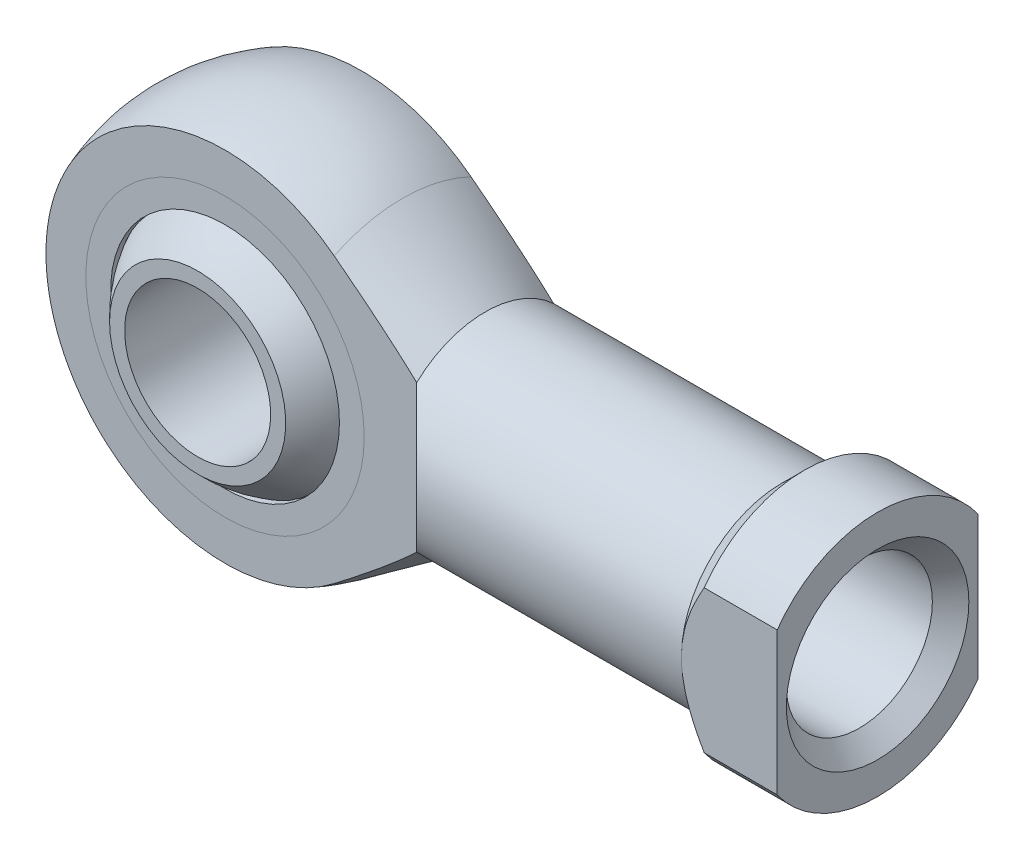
ISO-10303-21;
HEADER;
FILE_DESCRIPTION(('STEP AP214'),'2;1');
FILE_NAME('part.step','',(''),(''),'','','');
FILE_SCHEMA(('AUTOMOTIVE_DESIGN { 1 0 10303 214 1 1 1 1 }'));
ENDSEC;
DATA;
#1=APPLICATION_CONTEXT('core data for automotive mechanical design processes');
#2=APPLICATION_PROTOCOL_DEFINITION('international standard','automotive_design',2000,#1);
#3=PRODUCT_CONTEXT('',#1,'mechanical');
#4=PRODUCT('Part','Part','',(#3));
#5=PRODUCT_RELATED_PRODUCT_CATEGORY('part','',(#4));
#6=PRODUCT_DEFINITION_FORMATION('','',#4);
#7=PRODUCT_DEFINITION_CONTEXT('part definition',#1,'design');
#8=PRODUCT_DEFINITION('design','',#6,#7);
#9=PRODUCT_DEFINITION_SHAPE('','',#8);
#10=(LENGTH_UNIT() NAMED_UNIT(*) SI_UNIT(.MILLI.,.METRE.));
#11=(NAMED_UNIT(*) PLANE_ANGLE_UNIT() SI_UNIT($,.RADIAN.));
#12=(NAMED_UNIT(*) SI_UNIT($,.STERADIAN.) SOLID_ANGLE_UNIT());
#13=UNCERTAINTY_MEASURE_WITH_UNIT(LENGTH_MEASURE(1.E-05),#10,'distance_accuracy_value','');
#14=(GEOMETRIC_REPRESENTATION_CONTEXT(3) GLOBAL_UNCERTAINTY_ASSIGNED_CONTEXT((#13)) GLOBAL_UNIT_ASSIGNED_CONTEXT((#10,
#11,#12)) REPRESENTATION_CONTEXT('',''));
#15=CARTESIAN_POINT('',(0.,0.,0.));
#16=DIRECTION('',(0.,0.,1.));
#17=DIRECTION('',(1.,0.,0.));
#18=AXIS2_PLACEMENT_3D('',#15,#16,#17);
#19=CARTESIAN_POINT('',(0.,0.,0.));
#20=DIRECTION('',(0.,1.,0.));
#21=DIRECTION('',(1.,0.,0.));
#22=AXIS2_PLACEMENT_3D('',#19,#20,#21);
#23=SPHERICAL_SURFACE('',#22,14.26);
#24=CARTESIAN_POINT('',(0.,0.,0.));
#25=DIRECTION('',(0.,0.,-1.));
#26=DIRECTION('',(-1.,0.,0.));
#27=AXIS2_PLACEMENT_3D('',#24,#25,#26);
#28=SPHERICAL_SURFACE('',#27,14.26);
#29=CARTESIAN_POINT('',(0.,0.,10.5));
#30=DIRECTION('',(0.,0.,-1.));
#31=DIRECTION('',(-1.,0.,0.));
#32=AXIS2_PLACEMENT_3D('',#29,#30,#31);
#33=CIRCLE('',#32,9.64870975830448);
#34=CARTESIAN_POINT('',(-9.64870975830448,0.,10.5));
#35=VERTEX_POINT('',#34);
#36=EDGE_CURVE('P0_E26',#35,#35,#33,.F.);
#37=ORIENTED_EDGE('',*,*,#36,.F.);
#38=EDGE_LOOP('',(#37));
#39=FACE_BOUND('',#38,.T.);
#40=CARTESIAN_POINT('',(0.,0.,-10.5));
#41=DIRECTION('',(0.,0.,1.));
#42=DIRECTION('',(1.,0.,0.));
#43=AXIS2_PLACEMENT_3D('',#40,#41,#42);
#44=CIRCLE('',#43,9.64870975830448);
#45=CARTESIAN_POINT('',(9.64870975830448,0.,-10.5));
#46=VERTEX_POINT('',#45);
#47=EDGE_CURVE('P0_E10',#46,#46,#44,.F.);
#48=ORIENTED_EDGE('',*,*,#47,.F.);
#49=EDGE_LOOP('',(#48));
#50=FACE_BOUND('',#49,.T.);
#51=ADVANCED_FACE('P0_F14',(#39,#50),#28,.T.);
#52=CARTESIAN_POINT('',(0.,0.,-14.26));
#53=DIRECTION('',(0.,0.,1.));
#54=DIRECTION('',(1.,0.,0.));
#55=AXIS2_PLACEMENT_3D('',#52,#53,#54);
#56=CYLINDRICAL_SURFACE('',#55,8.);
#57=CARTESIAN_POINT('',(0.,0.,10.5));
#58=DIRECTION('',(0.,0.,-1.));
#59=DIRECTION('',(-1.,0.,0.));
#60=AXIS2_PLACEMENT_3D('',#57,#58,#59);
#61=CIRCLE('',#60,8.);
#62=CARTESIAN_POINT('',(8.,0.,10.5));
#63=VERTEX_POINT('',#62);
#64=EDGE_CURVE('P0_E17',#63,#63,#61,.F.);
#65=CARTESIAN_POINT('',(0.,0.,-10.5));
#66=DIRECTION('',(0.,0.,1.));
#67=DIRECTION('',(1.,0.,0.));
#68=AXIS2_PLACEMENT_3D('',#65,#66,#67);
#69=CIRCLE('',#68,8.);
#70=CARTESIAN_POINT('',(8.,0.,-10.5));
#71=VERTEX_POINT('',#70);
#72=EDGE_CURVE('P0_E21',#71,#71,#69,.F.);
#73=CARTESIAN_POINT('',(8.,0.,10.5));
#74=CARTESIAN_POINT('',(8.,0.,10.28125));
#75=CARTESIAN_POINT('',(8.,0.,10.0625));
#76=CARTESIAN_POINT('',(8.,0.,9.625));
#77=CARTESIAN_POINT('',(8.,0.,9.40625));
#78=CARTESIAN_POINT('',(8.,0.,8.96875));
#79=CARTESIAN_POINT('',(8.,0.,8.75));
#80=CARTESIAN_POINT('',(8.,0.,8.3125));
#81=CARTESIAN_POINT('',(8.,0.,8.09375));
#82=CARTESIAN_POINT('',(8.,0.,7.65625));
#83=CARTESIAN_POINT('',(8.,0.,7.4375));
#84=CARTESIAN_POINT('',(8.,0.,7.));
#85=CARTESIAN_POINT('',(8.,0.,6.78125));
#86=CARTESIAN_POINT('',(8.,0.,6.34375));
#87=CARTESIAN_POINT('',(8.,0.,6.125));
#88=CARTESIAN_POINT('',(8.,0.,5.6875));
#89=CARTESIAN_POINT('',(8.,0.,5.46875));
#90=CARTESIAN_POINT('',(8.,0.,5.03125));
#91=CARTESIAN_POINT('',(8.,0.,4.8125));
#92=CARTESIAN_POINT('',(8.,0.,4.375));
#93=CARTESIAN_POINT('',(8.,0.,4.15625));
#94=CARTESIAN_POINT('',(8.,0.,3.71875));
#95=CARTESIAN_POINT('',(8.,0.,3.5));
#96=CARTESIAN_POINT('',(8.,0.,3.0625));
#97=CARTESIAN_POINT('',(8.,0.,2.84375));
#98=CARTESIAN_POINT('',(8.,0.,2.40625));
#99=CARTESIAN_POINT('',(8.,0.,2.1875));
#100=CARTESIAN_POINT('',(8.,0.,1.75));
#101=CARTESIAN_POINT('',(8.,0.,1.53125));
#102=CARTESIAN_POINT('',(8.,0.,1.09375));
#103=CARTESIAN_POINT('',(8.,0.,0.875000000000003));
#104=CARTESIAN_POINT('',(8.,0.,0.437500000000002));
#105=CARTESIAN_POINT('',(8.,0.,0.218750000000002));
#106=CARTESIAN_POINT('',(8.,0.,-0.218749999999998));
#107=CARTESIAN_POINT('',(8.,0.,-0.437499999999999));
#108=CARTESIAN_POINT('',(8.,0.,-0.874999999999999));
#109=CARTESIAN_POINT('',(8.,0.,-1.09375));
#110=CARTESIAN_POINT('',(8.,0.,-1.53125));
#111=CARTESIAN_POINT('',(8.,0.,-1.75));
#112=CARTESIAN_POINT('',(8.,0.,-2.1875));
#113=CARTESIAN_POINT('',(8.,0.,-2.40625));
#114=CARTESIAN_POINT('',(8.,0.,-2.84375));
#115=CARTESIAN_POINT('',(8.,0.,-3.0625));
#116=CARTESIAN_POINT('',(8.,0.,-3.5));
#117=CARTESIAN_POINT('',(8.,0.,-3.71875));
#118=CARTESIAN_POINT('',(8.,0.,-4.15625));
#119=CARTESIAN_POINT('',(8.,0.,-4.375));
#120=CARTESIAN_POINT('',(8.,0.,-4.8125));
#121=CARTESIAN_POINT('',(8.,0.,-5.03125));
#122=CARTESIAN_POINT('',(8.,0.,-5.46875));
#123=CARTESIAN_POINT('',(8.,0.,-5.6875));
#124=CARTESIAN_POINT('',(8.,0.,-6.125));
#125=CARTESIAN_POINT('',(8.,0.,-6.34375));
#126=CARTESIAN_POINT('',(8.,0.,-6.78125));
#127=CARTESIAN_POINT('',(8.,0.,-7.));
#128=CARTESIAN_POINT('',(8.,0.,-7.4375));
#129=CARTESIAN_POINT('',(8.,0.,-7.65625));
#130=CARTESIAN_POINT('',(8.,0.,-8.09375));
#131=CARTESIAN_POINT('',(8.,0.,-8.3125));
#132=CARTESIAN_POINT('',(8.,0.,-8.75));
#133=CARTESIAN_POINT('',(8.,0.,-8.96875));
#134=CARTESIAN_POINT('',(8.,0.,-9.40625));
#135=CARTESIAN_POINT('',(8.,0.,-9.625));
#136=CARTESIAN_POINT('',(8.,0.,-10.0625));
#137=CARTESIAN_POINT('',(8.,0.,-10.28125));
#138=CARTESIAN_POINT('',(8.,0.,-10.5));
#139=B_SPLINE_CURVE_WITH_KNOTS('',3,(#73,#74,#75,#76,#77,#78,#79,#80,#81,#82,#83,#84,#85,#86,
#87,#88,#89,#90,#91,#92,#93,#94,#95,#96,#97,#98,#99,#100,#101,#102,#103,#104,#105,#106,#107,
#108,#109,#110,#111,#112,#113,#114,#115,#116,#117,#118,#119,#120,#121,#122,#123,#124,#125,#126,
#127,#128,#129,#130,#131,#132,#133,#134,#135,#136,#137,#138),.UNSPECIFIED.,.F.,.F.,(4,2,2,2,2,2,
2,2,2,2,2,2,2,2,2,2,2,2,2,2,2,2,2,2,2,2,2,2,2,2,2,2,4),(0.,0.656250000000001,1.3125,1.96875,
2.625,3.28125,3.9375,4.59375,5.25,5.90625,6.5625,7.21875,7.875,8.53125,9.1875,9.84375,10.5,
11.15625,11.8125,12.46875,13.125,13.78125,14.4375,15.09375,15.75,16.40625,17.0625,17.71875,
18.375,19.03125,19.6875,20.34375,21.),.UNSPECIFIED.);
#140=EDGE_CURVE('P0_BSEAM34',#63,#71,#139,.T.);
#141=ORIENTED_EDGE('',*,*,#64,.T.);
#142=ORIENTED_EDGE('',*,*,#72,.T.);
#143=ORIENTED_EDGE('',*,*,#140,.T.);
#144=ORIENTED_EDGE('',*,*,#140,.F.);
#145=EDGE_LOOP('',(#141,#143,#142,#144));
#146=FACE_BOUND('',#145,.T.);
#147=ADVANCED_FACE('P0_F34',(#146),#56,.F.);
#148=CARTESIAN_POINT('',(-14.26,-14.26,-10.5));
#149=DIRECTION('',(0.,0.,1.));
#150=DIRECTION('',(1.,0.,0.));
#151=AXIS2_PLACEMENT_3D('',#148,#149,#150);
#152=PLANE('',#151);
#153=ORIENTED_EDGE('',*,*,#47,.T.);
#154=EDGE_LOOP('',(#153));
#155=FACE_BOUND('',#154,.T.);
#156=ORIENTED_EDGE('',*,*,#72,.F.);
#157=EDGE_LOOP('',(#156));
#158=FACE_BOUND('',#157,.T.);
#159=ADVANCED_FACE('P0_F39',(#155,#158),#152,.F.);
#160=CARTESIAN_POINT('',(-14.26,-14.26,10.5));
#161=DIRECTION('',(0.,0.,-1.));
#162=DIRECTION('',(-1.,0.,0.));
#163=AXIS2_PLACEMENT_3D('',#160,#161,#162);
#164=PLANE('',#163);
#165=ORIENTED_EDGE('',*,*,#36,.T.);
#166=EDGE_LOOP('',(#165));
#167=FACE_BOUND('',#166,.T.);
#168=ORIENTED_EDGE('',*,*,#64,.F.);
#169=EDGE_LOOP('',(#168));
#170=FACE_BOUND('',#169,.T.);
#171=ADVANCED_FACE('P0_F37',(#167,#170),#164,.F.);
#172=CLOSED_SHELL('',(#51,#147,#159,#171));
#173=MANIFOLD_SOLID_BREP('P0_B1',#172);
#174=CARTESIAN_POINT('',(0.,0.,7.5));
#175=DIRECTION('',(0.,0.,1.));
#176=DIRECTION('',(1.,0.,0.));
#177=AXIS2_PLACEMENT_3D('',#174,#175,#176);
#178=PLANE('',#177);
#179=CARTESIAN_POINT('',(0.,0.,7.5));
#180=DIRECTION('',(0.,0.,1.));
#181=DIRECTION('',(1.,0.,0.));
#182=AXIS2_PLACEMENT_3D('',#179,#180,#181);
#183=CIRCLE('',#182,15.25);
#184=CARTESIAN_POINT('',(15.25,0.,7.5));
#185=VERTEX_POINT('',#184);
#186=EDGE_CURVE('P1_E10',#185,#185,#183,.T.);
#187=ORIENTED_EDGE('',*,*,#186,.T.);
#188=EDGE_LOOP('',(#187));
#189=FACE_BOUND('',#188,.T.);
#190=CARTESIAN_POINT('',(0.,0.,7.5));
#191=DIRECTION('',(0.,0.,1.));
#192=DIRECTION('',(1.,0.,0.));
#193=AXIS2_PLACEMENT_3D('',#190,#191,#192);
#194=CIRCLE('',#193,12.535);
#195=CARTESIAN_POINT('',(12.535,0.,7.5));
#196=VERTEX_POINT('',#195);
#197=EDGE_CURVE('P1_E25',#196,#196,#194,.T.);
#198=ORIENTED_EDGE('',*,*,#197,.F.);
#199=EDGE_LOOP('',(#198));
#200=FACE_BOUND('',#199,.T.);
#201=ADVANCED_FACE('P1_F14',(#189,#200),#178,.T.);
#202=CARTESIAN_POINT('',(0.,0.,6.8));
#203=DIRECTION('',(0.,0.,1.));
#204=DIRECTION('',(1.,0.,0.));
#205=AXIS2_PLACEMENT_3D('',#202,#203,#204);
#206=PLANE('',#205);
#207=CARTESIAN_POINT('',(0.,0.,6.8));
#208=DIRECTION('',(0.,0.,1.));
#209=DIRECTION('',(1.,0.,0.));
#210=AXIS2_PLACEMENT_3D('',#207,#208,#209);
#211=CIRCLE('',#210,15.25);
#212=CARTESIAN_POINT('',(15.25,0.,6.8));
#213=VERTEX_POINT('',#212);
#214=EDGE_CURVE('P1_E18',#213,#213,#211,.T.);
#215=ORIENTED_EDGE('',*,*,#214,.F.);
#216=EDGE_LOOP('',(#215));
#217=FACE_BOUND('',#216,.T.);
#218=CARTESIAN_POINT('',(0.,0.,6.8));
#219=DIRECTION('',(0.,0.,1.));
#220=DIRECTION('',(1.,0.,0.));
#221=AXIS2_PLACEMENT_3D('',#218,#219,#220);
#222=CIRCLE('',#221,12.535);
#223=CARTESIAN_POINT('',(12.535,0.,6.8));
#224=VERTEX_POINT('',#223);
#225=EDGE_CURVE('P1_E27',#224,#224,#222,.T.);
#226=ORIENTED_EDGE('',*,*,#225,.T.);
#227=EDGE_LOOP('',(#226));
#228=FACE_BOUND('',#227,.T.);
#229=ADVANCED_FACE('P1_F37',(#217,#228),#206,.F.);
#230=CARTESIAN_POINT('',(0.,0.,7.5));
#231=DIRECTION('',(0.,0.,-1.));
#232=DIRECTION('',(-1.,0.,0.));
#233=AXIS2_PLACEMENT_3D('',#230,#231,#232);
#234=CYLINDRICAL_SURFACE('',#233,15.25);
#235=ORIENTED_EDGE('',*,*,#186,.F.);
#236=EDGE_LOOP('',(#235));
#237=FACE_BOUND('',#236,.T.);
#238=ORIENTED_EDGE('',*,*,#214,.T.);
#239=EDGE_LOOP('',(#238));
#240=FACE_BOUND('',#239,.T.);
#241=ADVANCED_FACE('P1_F16',(#237,#240),#234,.T.);
#242=CARTESIAN_POINT('',(0.,0.,7.5));
#243=DIRECTION('',(0.,0.,-1.));
#244=DIRECTION('',(-1.,0.,0.));
#245=AXIS2_PLACEMENT_3D('',#242,#243,#244);
#246=CYLINDRICAL_SURFACE('',#245,12.535);
#247=ORIENTED_EDGE('',*,*,#197,.T.);
#248=EDGE_LOOP('',(#247));
#249=FACE_BOUND('',#248,.T.);
#250=ORIENTED_EDGE('',*,*,#225,.F.);
#251=EDGE_LOOP('',(#250));
#252=FACE_BOUND('',#251,.T.);
#253=ADVANCED_FACE('P1_F33',(#249,#252),#246,.F.);
#254=CLOSED_SHELL('',(#201,#229,#241,#253));
#255=MANIFOLD_SOLID_BREP('P1_B1',#254);
#256=CARTESIAN_POINT('',(0.,0.,-6.8));
#257=DIRECTION('',(0.,0.,1.));
#258=DIRECTION('',(1.,0.,0.));
#259=AXIS2_PLACEMENT_3D('',#256,#257,#258);
#260=PLANE('',#259);
#261=CARTESIAN_POINT('',(0.,0.,-6.8));
#262=DIRECTION('',(0.,0.,1.));
#263=DIRECTION('',(1.,0.,0.));
#264=AXIS2_PLACEMENT_3D('',#261,#262,#263);
#265=CIRCLE('',#264,15.25);
#266=CARTESIAN_POINT('',(15.25,0.,-6.8));
#267=VERTEX_POINT('',#266);
#268=EDGE_CURVE('P2_E10',#267,#267,#265,.T.);
#269=ORIENTED_EDGE('',*,*,#268,.T.);
#270=EDGE_LOOP('',(#269));
#271=FACE_BOUND('',#270,.T.);
#272=CARTESIAN_POINT('',(0.,0.,-6.8));
#273=DIRECTION('',(0.,0.,1.));
#274=DIRECTION('',(1.,0.,0.));
#275=AXIS2_PLACEMENT_3D('',#272,#273,#274);
#276=CIRCLE('',#275,12.535);
#277=CARTESIAN_POINT('',(12.535,0.,-6.8));
#278=VERTEX_POINT('',#277);
#279=EDGE_CURVE('P2_E25',#278,#278,#276,.T.);
#280=ORIENTED_EDGE('',*,*,#279,.F.);
#281=EDGE_LOOP('',(#280));
#282=FACE_BOUND('',#281,.T.);
#283=ADVANCED_FACE('P2_F14',(#271,#282),#260,.T.);
#284=CARTESIAN_POINT('',(0.,0.,-7.5));
#285=DIRECTION('',(0.,0.,1.));
#286=DIRECTION('',(1.,0.,0.));
#287=AXIS2_PLACEMENT_3D('',#284,#285,#286);
#288=PLANE('',#287);
#289=CARTESIAN_POINT('',(0.,0.,-7.5));
#290=DIRECTION('',(0.,0.,1.));
#291=DIRECTION('',(1.,0.,0.));
#292=AXIS2_PLACEMENT_3D('',#289,#290,#291);
#293=CIRCLE('',#292,15.25);
#294=CARTESIAN_POINT('',(15.25,0.,-7.5));
#295=VERTEX_POINT('',#294);
#296=EDGE_CURVE('P2_E18',#295,#295,#293,.T.);
#297=ORIENTED_EDGE('',*,*,#296,.F.);
#298=EDGE_LOOP('',(#297));
#299=FACE_BOUND('',#298,.T.);
#300=CARTESIAN_POINT('',(0.,0.,-7.5));
#301=DIRECTION('',(0.,0.,1.));
#302=DIRECTION('',(1.,0.,0.));
#303=AXIS2_PLACEMENT_3D('',#300,#301,#302);
#304=CIRCLE('',#303,12.535);
#305=CARTESIAN_POINT('',(12.535,0.,-7.5));
#306=VERTEX_POINT('',#305);
#307=EDGE_CURVE('P2_E27',#306,#306,#304,.T.);
#308=ORIENTED_EDGE('',*,*,#307,.T.);
#309=EDGE_LOOP('',(#308));
#310=FACE_BOUND('',#309,.T.);
#311=ADVANCED_FACE('P2_F37',(#299,#310),#288,.F.);
#312=CARTESIAN_POINT('',(0.,0.,-6.8));
#313=DIRECTION('',(0.,0.,-1.));
#314=DIRECTION('',(-1.,0.,0.));
#315=AXIS2_PLACEMENT_3D('',#312,#313,#314);
#316=CYLINDRICAL_SURFACE('',#315,15.25);
#317=ORIENTED_EDGE('',*,*,#268,.F.);
#318=EDGE_LOOP('',(#317));
#319=FACE_BOUND('',#318,.T.);
#320=ORIENTED_EDGE('',*,*,#296,.T.);
#321=EDGE_LOOP('',(#320));
#322=FACE_BOUND('',#321,.T.);
#323=ADVANCED_FACE('P2_F16',(#319,#322),#316,.T.);
#324=CARTESIAN_POINT('',(0.,0.,-6.8));
#325=DIRECTION('',(0.,0.,-1.));
#326=DIRECTION('',(-1.,0.,0.));
#327=AXIS2_PLACEMENT_3D('',#324,#325,#326);
#328=CYLINDRICAL_SURFACE('',#327,12.535);
#329=ORIENTED_EDGE('',*,*,#279,.T.);
#330=EDGE_LOOP('',(#329));
#331=FACE_BOUND('',#330,.T.);
#332=ORIENTED_EDGE('',*,*,#307,.F.);
#333=EDGE_LOOP('',(#332));
#334=FACE_BOUND('',#333,.T.);
#335=ADVANCED_FACE('P2_F33',(#331,#334),#328,.F.);
#336=CLOSED_SHELL('',(#283,#311,#323,#335));
#337=MANIFOLD_SOLID_BREP('P2_B1',#336);
#338=CARTESIAN_POINT('',(0.,0.,0.));
#339=DIRECTION('',(0.,1.,0.));
#340=DIRECTION('',(1.,0.,0.));
#341=AXIS2_PLACEMENT_3D('',#338,#339,#340);
#342=SPHERICAL_SURFACE('',#341,14.26);
#343=CARTESIAN_POINT('',(0.,0.,0.));
#344=DIRECTION('',(0.,0.,1.));
#345=DIRECTION('',(1.,0.,0.));
#346=AXIS2_PLACEMENT_3D('',#343,#344,#345);
#347=SPHERICAL_SURFACE('',#346,14.26);
#348=CARTESIAN_POINT('',(0.,0.,6.8));
#349=DIRECTION('',(0.,0.,1.));
#350=DIRECTION('',(1.,0.,0.));
#351=AXIS2_PLACEMENT_3D('',#348,#349,#350);
#352=CIRCLE('',#351,12.5342570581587);
#353=CARTESIAN_POINT('',(12.5342570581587,0.,6.8));
#354=VERTEX_POINT('',#353);
#355=EDGE_CURVE('P3_E73',#354,#354,#352,.F.);
#356=ORIENTED_EDGE('',*,*,#355,.F.);
#357=EDGE_LOOP('',(#356));
#358=FACE_BOUND('',#357,.T.);
#359=CARTESIAN_POINT('',(0.,0.,-6.8));
#360=DIRECTION('',(0.,0.,-1.));
#361=DIRECTION('',(-1.,0.,0.));
#362=AXIS2_PLACEMENT_3D('',#359,#360,#361);
#363=CIRCLE('',#362,12.5342570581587);
#364=CARTESIAN_POINT('',(-12.5342570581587,0.,-6.8));
#365=VERTEX_POINT('',#364);
#366=EDGE_CURVE('P3_E20',#365,#365,#363,.F.);
#367=ORIENTED_EDGE('',*,*,#366,.F.);
#368=EDGE_LOOP('',(#367));
#369=FACE_BOUND('',#368,.T.);
#370=ADVANCED_FACE('P3_F16',(#358,#369),#347,.F.);
#371=CARTESIAN_POINT('',(-21.,-21.,-7.5));
#372=DIRECTION('',(0.,0.,1.));
#373=DIRECTION('',(1.,0.,0.));
#374=AXIS2_PLACEMENT_3D('',#371,#372,#373);
#375=PLANE('',#374);
#376=CARTESIAN_POINT('',(0.,0.,-7.5));
#377=DIRECTION('',(0.,0.,1.));
#378=DIRECTION('',(1.,0.,0.));
#379=AXIS2_PLACEMENT_3D('',#376,#377,#378);
#380=CIRCLE('',#379,19.615045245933);
#381=CARTESIAN_POINT('',(11.9572953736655,15.5490542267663,-7.5));
#382=VERTEX_POINT('',#381);
#383=CARTESIAN_POINT('',(11.9572953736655,-15.5490542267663,-7.5));
#384=VERTEX_POINT('',#383);
#385=EDGE_CURVE('P3_E11',#382,#384,#380,.T.);
#386=ORIENTED_EDGE('',*,*,#385,.F.);
#387=CARTESIAN_POINT('',(-9.45763386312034,-31.2076246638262,-7.5));
#388=CARTESIAN_POINT('',(-8.86791598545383,-30.7875296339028,-7.5));
#389=CARTESIAN_POINT('',(-8.27841458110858,-30.3671307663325,-7.5));
#390=CARTESIAN_POINT('',(-7.09990685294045,-29.5256380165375,-7.5));
#391=CARTESIAN_POINT('',(-6.51090052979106,-29.1045441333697,-7.5));
#392=CARTESIAN_POINT('',(-4.74416233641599,-27.8396915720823,-7.5));
#393=CARTESIAN_POINT('',(-3.56726974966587,-26.9947595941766,-7.5));
#394=CARTESIAN_POINT('',(-1.20302552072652,-25.2911571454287,-7.5));
#395=CARTESIAN_POINT('',(-0.015707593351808,-24.4324398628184,-7.5));
#396=CARTESIAN_POINT('',(2.35430669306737,-22.7097891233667,-7.5));
#397=CARTESIAN_POINT('',(3.53700493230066,-21.8458582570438,-7.5));
#398=CARTESIAN_POINT('',(5.50839036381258,-20.3957425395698,-7.5));
#399=CARTESIAN_POINT('',(6.29866238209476,-19.8117134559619,-7.5));
#400=CARTESIAN_POINT('',(7.87583382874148,-18.639122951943,-7.5));
#401=CARTESIAN_POINT('',(8.66273327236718,-18.050561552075,-7.5));
#402=CARTESIAN_POINT('',(10.2333560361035,-16.8665670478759,-7.5));
#403=CARTESIAN_POINT('',(11.0170721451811,-16.2711243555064,-7.5));
#404=CARTESIAN_POINT('',(12.1879888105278,-15.3719967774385,-7.5));
#405=CARTESIAN_POINT('',(12.577493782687,-15.0713127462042,-7.5));
#406=CARTESIAN_POINT('',(13.3546688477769,-14.4675838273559,-7.5));
#407=CARTESIAN_POINT('',(13.7423389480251,-14.1645389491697,-7.5));
#408=CARTESIAN_POINT('',(14.5124283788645,-13.5580582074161,-7.5));
#409=CARTESIAN_POINT('',(14.8948650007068,-13.2546443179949,-7.5));
#410=CARTESIAN_POINT('',(15.6571054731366,-12.6445304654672,-7.5));
#411=CARTESIAN_POINT('',(16.0369093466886,-12.3378305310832,-7.5));
#412=CARTESIAN_POINT('',(16.7934881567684,-11.7202824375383,-7.5));
#413=CARTESIAN_POINT('',(17.1702612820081,-11.4094320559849,-7.5));
#414=CARTESIAN_POINT('',(17.9197295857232,-10.7828643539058,-7.5));
#415=CARTESIAN_POINT('',(18.2924248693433,-10.4671471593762,-7.5));
#416=CARTESIAN_POINT('',(19.0315442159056,-9.83057425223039,-7.5));
#417=CARTESIAN_POINT('',(19.3979832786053,-9.50973600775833,-7.5));
#418=CARTESIAN_POINT('',(20.1241211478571,-8.86041568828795,-7.5));
#419=CARTESIAN_POINT('',(20.4838191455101,-8.53193270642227,-7.5));
#420=CARTESIAN_POINT('',(21.1937591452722,-7.86550788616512,-7.5));
#421=CARTESIAN_POINT('',(21.5440100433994,-7.52757560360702,-7.5));
#422=CARTESIAN_POINT('',(22.0597337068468,-7.01111868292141,-7.5));
#423=CARTESIAN_POINT('',(22.2300147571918,-6.83739277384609,-7.5));
#424=CARTESIAN_POINT('',(22.5667054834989,-6.48623525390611,-7.5));
#425=CARTESIAN_POINT('',(22.7331154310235,-6.30880390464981,-7.5));
#426=CARTESIAN_POINT('',(22.9571659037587,-6.06356175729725,-7.5));
#427=CARTESIAN_POINT('',(23.0168442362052,-5.99760782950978,-7.5));
#428=CARTESIAN_POINT('',(23.135523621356,-5.86508964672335,-7.5));
#429=CARTESIAN_POINT('',(23.1945246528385,-5.79852537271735,-7.5));
#430=CARTESIAN_POINT('',(23.3704438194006,-5.59785511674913,-7.5));
#431=CARTESIAN_POINT('',(23.4862664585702,-5.46278432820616,-7.5));
#432=CARTESIAN_POINT('',(23.7145583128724,-5.18969236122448,-7.5));
#433=CARTESIAN_POINT('',(23.8270254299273,-5.05166942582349,-7.5));
#434=CARTESIAN_POINT('',(24.0479158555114,-4.77242083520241,-7.5));
#435=CARTESIAN_POINT('',(24.1563392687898,-4.63119526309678,-7.5));
#436=CARTESIAN_POINT('',(24.367049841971,-4.34697678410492,-7.5));
#437=CARTESIAN_POINT('',(24.4693971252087,-4.20402859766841,-7.5));
#438=CARTESIAN_POINT('',(24.6685012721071,-3.91429474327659,-7.5));
#439=CARTESIAN_POINT('',(24.7652586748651,-3.76750944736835,-7.5));
#440=CARTESIAN_POINT('',(24.9520035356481,-3.46984990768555,-7.5));
#441=CARTESIAN_POINT('',(25.0419967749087,-3.31897930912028,-7.5));
#442=CARTESIAN_POINT('',(25.2139355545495,-3.01274017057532,-7.5));
#443=CARTESIAN_POINT('',(25.2958831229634,-2.85737277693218,-7.5));
#444=CARTESIAN_POINT('',(25.4465616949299,-2.54921368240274,-7.5));
#445=CARTESIAN_POINT('',(25.5157294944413,-2.39663692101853,-7.5));
#446=CARTESIAN_POINT('',(25.6436858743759,-2.08717627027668,-7.5));
#447=CARTESIAN_POINT('',(25.7024757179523,-1.93029290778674,-7.5));
#448=CARTESIAN_POINT('',(25.8078432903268,-1.61277886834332,-7.5));
#449=CARTESIAN_POINT('',(25.8544447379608,-1.45215614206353,-7.5));
#450=CARTESIAN_POINT('',(25.9338727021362,-1.12755016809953,-7.5));
#451=CARTESIAN_POINT('',(25.9667031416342,-0.963567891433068,-7.5));
#452=CARTESIAN_POINT('',(26.0174734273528,-0.631343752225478,-7.5));
#453=CARTESIAN_POINT('',(26.0352370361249,-0.463074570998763,-7.5));
#454=CARTESIAN_POINT('',(26.0543418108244,-0.125607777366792,-7.5));
#455=CARTESIAN_POINT('',(26.0556842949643,0.0435897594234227,-7.5));
#456=CARTESIAN_POINT('',(26.041872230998,0.38147487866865,-7.5));
#457=CARTESIAN_POINT('',(26.0267008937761,0.550161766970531,-7.5));
#458=CARTESIAN_POINT('',(25.9806026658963,0.88536144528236,-7.5));
#459=CARTESIAN_POINT('',(25.9496731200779,1.05187386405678,-7.5));
#460=CARTESIAN_POINT('',(25.8665347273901,1.41147334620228,-7.5));
#461=CARTESIAN_POINT('',(25.8114830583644,1.60390003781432,-7.5));
#462=CARTESIAN_POINT('',(25.6842021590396,1.98300762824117,-7.5));
#463=CARTESIAN_POINT('',(25.6119631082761,2.16968517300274,-7.5));
#464=CARTESIAN_POINT('',(25.4530805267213,2.53728418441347,-7.5));
#465=CARTESIAN_POINT('',(25.3664020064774,2.71819036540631,-7.5));
#466=CARTESIAN_POINT('',(25.1814264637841,3.07386850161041,-7.5));
#467=CARTESIAN_POINT('',(25.083130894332,3.24864122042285,-7.5));
#468=CARTESIAN_POINT('',(24.8334923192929,3.66535386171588,-7.5));
#469=CARTESIAN_POINT('',(24.6773152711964,3.90438782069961,-7.5));
#470=CARTESIAN_POINT('',(24.3507371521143,4.372588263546,-7.5));
#471=CARTESIAN_POINT('',(24.1803281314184,4.60174912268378,-7.5));
#472=CARTESIAN_POINT('',(23.8284265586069,5.05213744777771,-7.5));
#473=CARTESIAN_POINT('',(23.6469109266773,5.27334676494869,-7.5));
#474=CARTESIAN_POINT('',(23.2756601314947,5.70863734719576,-7.5));
#475=CARTESIAN_POINT('',(23.0859266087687,5.9227200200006,-7.5));
#476=CARTESIAN_POINT('',(22.6985910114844,6.34649316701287,-7.5));
#477=CARTESIAN_POINT('',(22.5009416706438,6.55614026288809,-7.5));
#478=CARTESIAN_POINT('',(22.1004215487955,6.97038473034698,-7.5));
#479=CARTESIAN_POINT('',(21.8975505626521,7.17498190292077,-7.5));
#480=CARTESIAN_POINT('',(21.4878734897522,7.57962371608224,-7.5));
#481=CARTESIAN_POINT('',(21.2810731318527,7.77967417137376,-7.5));
#482=CARTESIAN_POINT('',(20.8640329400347,8.17613421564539,-7.5));
#483=CARTESIAN_POINT('',(20.6537932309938,8.37254393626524,-7.5));
#484=CARTESIAN_POINT('',(20.1989898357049,8.79121363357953,-7.5));
#485=CARTESIAN_POINT('',(19.9539691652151,9.01297662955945,-7.5));
#486=CARTESIAN_POINT('',(19.4608273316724,9.45303171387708,-7.5));
#487=CARTESIAN_POINT('',(19.2127060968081,9.67132372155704,-7.5));
#488=CARTESIAN_POINT('',(18.4644597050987,10.3218264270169,-7.5));
#489=CARTESIAN_POINT('',(17.9604967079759,10.7496229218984,-7.5));
#490=CARTESIAN_POINT('',(16.9451317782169,11.5966372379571,-7.5));
#491=CARTESIAN_POINT('',(16.4337271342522,12.0158517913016,-7.5));
#492=CARTESIAN_POINT('',(15.4055077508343,12.8476047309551,-7.5));
#493=CARTESIAN_POINT('',(14.8886928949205,13.2601429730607,-7.5));
#494=CARTESIAN_POINT('',(13.8501430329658,14.0806335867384,-7.5));
#495=CARTESIAN_POINT('',(13.3284016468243,14.4885778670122,-7.5));
#496=CARTESIAN_POINT('',(12.2816838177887,15.3003020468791,-7.5));
#497=CARTESIAN_POINT('',(11.7567073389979,15.7040819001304,-7.5));
#498=CARTESIAN_POINT('',(10.7043039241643,16.5081755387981,-7.5));
#499=CARTESIAN_POINT('',(10.176877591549,16.9084901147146,-7.5));
#500=CARTESIAN_POINT('',(9.11993397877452,17.7063492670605,-7.5));
#501=CARTESIAN_POINT('',(8.59041669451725,18.1038938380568,-7.5));
#502=CARTESIAN_POINT('',(7.00338654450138,19.2900481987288,-7.5));
#503=CARTESIAN_POINT('',(5.9433384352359,20.0752655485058,-7.5));
#504=CARTESIAN_POINT('',(3.81844605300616,21.6392950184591,-7.5));
#505=CARTESIAN_POINT('',(2.75360151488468,22.4181067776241,-7.5));
#506=CARTESIAN_POINT('',(0.621138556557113,23.9704330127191,-7.5));
#507=CARTESIAN_POINT('',(-0.446477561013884,24.7439506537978,-7.5));
#508=CARTESIAN_POINT('',(-2.58433055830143,26.2873554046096,-7.5));
#509=CARTESIAN_POINT('',(-3.65456744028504,27.0572425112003,-7.5));
#510=CARTESIAN_POINT('',(-5.11951612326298,28.1081345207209,-7.5));
#511=CARTESIAN_POINT('',(-5.51334985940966,28.3903644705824,-7.5));
#512=CARTESIAN_POINT('',(-6.301302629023,28.9544952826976,-7.5));
#513=CARTESIAN_POINT('',(-6.69542168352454,29.2363961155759,-7.5));
#514=CARTESIAN_POINT('',(-7.48411654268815,29.8000357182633,-7.5));
#515=CARTESIAN_POINT('',(-7.87869247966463,30.0817743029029,-7.5));
#516=CARTESIAN_POINT('',(-8.66802441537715,30.6449290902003,-7.5));
#517=CARTESIAN_POINT('',(-9.06278039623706,30.9263453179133,-7.5));
#518=CARTESIAN_POINT('',(-9.45763386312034,31.2076246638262,-7.5));
#519=B_SPLINE_CURVE_WITH_KNOTS('',3,(#387,#388,#389,#390,#391,#392,#393,#394,#395,#396,#397,
#398,#399,#400,#401,#402,#403,#404,#405,#406,#407,#408,#409,#410,#411,#412,#413,#414,#415,#416,
#417,#418,#419,#420,#421,#422,#423,#424,#425,#426,#427,#428,#429,#430,#431,#432,#433,#434,#435,
#436,#437,#438,#439,#440,#441,#442,#443,#444,#445,#446,#447,#448,#449,#450,#451,#452,#453,#454,
#455,#456,#457,#458,#459,#460,#461,#462,#463,#464,#465,#466,#467,#468,#469,#470,#471,#472,#473,
#474,#475,#476,#477,#478,#479,#480,#481,#482,#483,#484,#485,#486,#487,#488,#489,#490,#491,#492,
#493,#494,#495,#496,#497,#498,#499,#500,#501,#502,#503,#504,#505,#506,#507,#508,#509,#510,#511,
#512,#513,#514,#515,#516,#517,#518),.UNSPECIFIED.,.F.,.F.,(4,2,2,2,2,2,2,2,2,2,2,2,2,2,2,2,2,2,
2,2,2,2,2,2,2,2,2,2,2,2,2,2,2,2,2,2,2,2,2,2,2,2,2,2,2,2,2,2,2,2,2,2,2,2,2,2,2,2,2,2,2,2,2,2,2,
4),(0.,2.17214690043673,4.34429675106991,8.69065319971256,13.0865578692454,17.4804335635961,
20.4283997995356,23.3763526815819,26.3290815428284,27.805260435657,29.2814334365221,
30.7459525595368,32.2104588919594,33.6757836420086,35.1410705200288,36.6021267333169,
38.0633571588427,39.5231598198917,40.2529018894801,40.9825926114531,41.2494273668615,
41.5162704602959,42.0500080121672,42.5840725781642,43.1181233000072,43.6454418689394,
44.1727094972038,44.6995212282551,45.226199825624,45.7284426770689,46.230624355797,
46.731821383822,47.2328755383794,47.7397127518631,48.246509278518,48.7538215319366,
49.2612192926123,49.8606854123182,50.4604948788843,51.0617795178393,51.6629890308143,
52.5188508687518,53.3751940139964,54.2333814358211,55.0913983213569,55.9556680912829,
56.8199718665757,57.6830998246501,58.5461965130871,59.5375816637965,60.528989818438,
62.5119881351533,64.4957279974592,66.4795106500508,68.4663654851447,70.4532424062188,
72.4396534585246,74.4260684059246,78.383605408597,82.3413639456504,86.2965027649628,
90.2516450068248,91.7052022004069,93.1588804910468,94.6133909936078,96.0677795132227),.UNSPECIFIED.);
#520=CARTESIAN_POINT('',(21.,8.04673846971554,-7.5));
#521=VERTEX_POINT('',#520);
#522=EDGE_CURVE('P3_E102',#521,#382,#519,.T.);
#523=ORIENTED_EDGE('',*,*,#522,.F.);
#524=DIRECTION('',(0.,1.,0.));
#525=VECTOR('',#524,1.);
#526=CARTESIAN_POINT('',(21.,-21.,-7.5));
#527=LINE('',#526,#525);
#528=CARTESIAN_POINT('',(21.,-8.04673846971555,-7.5));
#529=VERTEX_POINT('',#528);
#530=EDGE_CURVE('P3_E64',#529,#521,#527,.T.);
#531=ORIENTED_EDGE('',*,*,#530,.F.);
#532=EDGE_CURVE('P3_E33',#384,#529,#519,.T.);
#533=ORIENTED_EDGE('',*,*,#532,.F.);
#534=EDGE_LOOP('',(#386,#523,#531,#533));
#535=FACE_BOUND('',#534,.T.);
#536=CARTESIAN_POINT('',(0.,0.,-7.5));
#537=DIRECTION('',(0.,0.,1.));
#538=DIRECTION('',(1.,0.,0.));
#539=AXIS2_PLACEMENT_3D('',#536,#537,#538);
#540=CIRCLE('',#539,15.25);
#541=CARTESIAN_POINT('',(15.25,0.,-7.5));
#542=VERTEX_POINT('',#541);
#543=EDGE_CURVE('P3_E95',#542,#542,#540,.T.);
#544=ORIENTED_EDGE('',*,*,#543,.T.);
#545=EDGE_LOOP('',(#544));
#546=FACE_BOUND('',#545,.T.);
#547=ADVANCED_FACE('P3_F115',(#535,#546),#375,.F.);
#548=CARTESIAN_POINT('',(21.,0.,0.));
#549=DIRECTION('',(-1.,0.,0.));
#550=DIRECTION('',(0.,0.,1.));
#551=AXIS2_PLACEMENT_3D('',#548,#549,#550);
#552=CONICAL_SURFACE('',#551,11.,0.605769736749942);
#553=CARTESIAN_POINT('',(11.9572953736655,0.,0.));
#554=DIRECTION('',(-1.,0.,0.));
#555=DIRECTION('',(0.,0.,1.));
#556=AXIS2_PLACEMENT_3D('',#553,#554,#555);
#557=CIRCLE('',#556,17.2633451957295);
#558=CARTESIAN_POINT('',(11.9572953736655,-15.5490542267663,7.5));
#559=VERTEX_POINT('',#558);
#560=EDGE_CURVE('P3_E79',#384,#559,#557,.T.);
#561=ORIENTED_EDGE('',*,*,#560,.F.);
#562=ORIENTED_EDGE('',*,*,#532,.T.);
#563=CARTESIAN_POINT('',(21.,0.,0.));
#564=DIRECTION('',(-1.,0.,0.));
#565=DIRECTION('',(0.,0.,1.));
#566=AXIS2_PLACEMENT_3D('',#563,#564,#565);
#567=CIRCLE('',#566,11.);
#568=CARTESIAN_POINT('',(21.,-8.04673846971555,7.5));
#569=VERTEX_POINT('',#568);
#570=EDGE_CURVE('P3_E70',#529,#569,#567,.T.);
#571=ORIENTED_EDGE('',*,*,#570,.T.);
#572=CARTESIAN_POINT('',(-9.45763386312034,31.2076246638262,7.5));
#573=CARTESIAN_POINT('',(-8.86791598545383,30.7875296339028,7.5));
#574=CARTESIAN_POINT('',(-8.27841458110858,30.3671307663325,7.5));
#575=CARTESIAN_POINT('',(-7.09990685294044,29.5256380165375,7.5));
#576=CARTESIAN_POINT('',(-6.51090052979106,29.1045441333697,7.5));
#577=CARTESIAN_POINT('',(-4.74416233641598,27.8396915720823,7.5));
#578=CARTESIAN_POINT('',(-3.56726974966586,26.9947595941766,7.5));
#579=CARTESIAN_POINT('',(-1.2030255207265,25.2911571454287,7.5));
#580=CARTESIAN_POINT('',(-0.0157075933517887,24.4324398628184,7.5));
#581=CARTESIAN_POINT('',(2.35430669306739,22.7097891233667,7.5));
#582=CARTESIAN_POINT('',(3.53700493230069,21.8458582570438,7.5));
#583=CARTESIAN_POINT('',(5.50839036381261,20.3957425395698,7.5));
#584=CARTESIAN_POINT('',(6.29866238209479,19.8117134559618,7.5));
#585=CARTESIAN_POINT('',(7.8758338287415,18.639122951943,7.5));
#586=CARTESIAN_POINT('',(8.66273327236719,18.050561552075,7.5));
#587=CARTESIAN_POINT('',(10.2333560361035,16.8665670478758,7.5));
#588=CARTESIAN_POINT('',(11.0170721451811,16.2711243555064,7.5));
#589=CARTESIAN_POINT('',(12.1879888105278,15.3719967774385,7.5));
#590=CARTESIAN_POINT('',(12.577493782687,15.0713127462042,7.5));
#591=CARTESIAN_POINT('',(13.3546688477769,14.4675838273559,7.5));
#592=CARTESIAN_POINT('',(13.7423389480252,14.1645389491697,7.5));
#593=CARTESIAN_POINT('',(14.5124283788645,13.5580582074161,7.5));
#594=CARTESIAN_POINT('',(14.8948650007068,13.2546443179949,7.5));
#595=CARTESIAN_POINT('',(15.6571054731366,12.6445304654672,7.5));
#596=CARTESIAN_POINT('',(16.0369093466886,12.3378305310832,7.5));
#597=CARTESIAN_POINT('',(16.7934881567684,11.7202824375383,7.5));
#598=CARTESIAN_POINT('',(17.1702612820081,11.4094320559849,7.5));
#599=CARTESIAN_POINT('',(17.9197295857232,10.7828643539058,7.5));
#600=CARTESIAN_POINT('',(18.2924248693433,10.4671471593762,7.5));
#601=CARTESIAN_POINT('',(19.0315442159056,9.83057425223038,7.5));
#602=CARTESIAN_POINT('',(19.3979832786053,9.50973600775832,7.5));
#603=CARTESIAN_POINT('',(20.1241211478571,8.86041568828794,7.5));
#604=CARTESIAN_POINT('',(20.4838191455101,8.53193270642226,7.5));
#605=CARTESIAN_POINT('',(21.1937591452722,7.86550788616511,7.5));
#606=CARTESIAN_POINT('',(21.5440100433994,7.52757560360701,7.5));
#607=CARTESIAN_POINT('',(22.0597337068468,7.0111186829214,7.5));
#608=CARTESIAN_POINT('',(22.2300147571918,6.83739277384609,7.5));
#609=CARTESIAN_POINT('',(22.5667054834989,6.48623525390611,7.5));
#610=CARTESIAN_POINT('',(22.7331154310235,6.3088039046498,7.5));
#611=CARTESIAN_POINT('',(22.9571659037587,6.06356175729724,7.5));
#612=CARTESIAN_POINT('',(23.0168442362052,5.99760782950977,7.5));
#613=CARTESIAN_POINT('',(23.135523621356,5.86508964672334,7.5));
#614=CARTESIAN_POINT('',(23.1945246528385,5.79852537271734,7.5));
#615=CARTESIAN_POINT('',(23.3704438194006,5.59785511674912,7.5));
#616=CARTESIAN_POINT('',(23.4862664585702,5.46278432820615,7.5));
#617=CARTESIAN_POINT('',(23.7145583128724,5.18969236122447,7.5));
#618=CARTESIAN_POINT('',(23.8270254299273,5.05166942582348,7.5));
#619=CARTESIAN_POINT('',(24.0479158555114,4.77242083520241,7.5));
#620=CARTESIAN_POINT('',(24.1563392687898,4.63119526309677,7.5));
#621=CARTESIAN_POINT('',(24.367049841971,4.34697678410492,7.5));
#622=CARTESIAN_POINT('',(24.4693971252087,4.20402859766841,7.5));
#623=CARTESIAN_POINT('',(24.6685012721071,3.9142947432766,7.5));
#624=CARTESIAN_POINT('',(24.7652586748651,3.76750944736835,7.5));
#625=CARTESIAN_POINT('',(24.9520035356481,3.46984990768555,7.5));
#626=CARTESIAN_POINT('',(25.0419967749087,3.31897930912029,7.5));
#627=CARTESIAN_POINT('',(25.2139355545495,3.01274017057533,7.5));
#628=CARTESIAN_POINT('',(25.2958831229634,2.85737277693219,7.5));
#629=CARTESIAN_POINT('',(25.4465616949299,2.54921368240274,7.5));
#630=CARTESIAN_POINT('',(25.5157294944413,2.39663692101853,7.5));
#631=CARTESIAN_POINT('',(25.6436858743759,2.08717627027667,7.5));
#632=CARTESIAN_POINT('',(25.7024757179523,1.93029290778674,7.5));
#633=CARTESIAN_POINT('',(25.8078432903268,1.61277886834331,7.5));
#634=CARTESIAN_POINT('',(25.8544447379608,1.45215614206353,7.5));
#635=CARTESIAN_POINT('',(25.9338727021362,1.12755016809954,7.5));
#636=CARTESIAN_POINT('',(25.9667031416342,0.96356789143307,7.5));
#637=CARTESIAN_POINT('',(26.0174734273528,0.63134375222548,7.5));
#638=CARTESIAN_POINT('',(26.0352370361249,0.463074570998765,7.5));
#639=CARTESIAN_POINT('',(26.0543418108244,0.125607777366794,7.5));
#640=CARTESIAN_POINT('',(26.0556842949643,-0.0435897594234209,7.5));
#641=CARTESIAN_POINT('',(26.041872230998,-0.381474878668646,7.5));
#642=CARTESIAN_POINT('',(26.0267008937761,-0.550161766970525,7.5));
#643=CARTESIAN_POINT('',(25.9806026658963,-0.885361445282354,7.5));
#644=CARTESIAN_POINT('',(25.9496731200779,-1.05187386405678,7.5));
#645=CARTESIAN_POINT('',(25.8665347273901,-1.41147334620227,7.5));
#646=CARTESIAN_POINT('',(25.8114830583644,-1.60390003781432,7.5));
#647=CARTESIAN_POINT('',(25.6842021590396,-1.98300762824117,7.5));
#648=CARTESIAN_POINT('',(25.6119631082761,-2.16968517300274,7.5));
#649=CARTESIAN_POINT('',(25.4530805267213,-2.53728418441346,7.5));
#650=CARTESIAN_POINT('',(25.3664020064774,-2.7181903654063,7.5));
#651=CARTESIAN_POINT('',(25.1814264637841,-3.07386850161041,7.5));
#652=CARTESIAN_POINT('',(25.083130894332,-3.24864122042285,7.5));
#653=CARTESIAN_POINT('',(24.8334923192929,-3.66535386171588,7.5));
#654=CARTESIAN_POINT('',(24.6773152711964,-3.90438782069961,7.5));
#655=CARTESIAN_POINT('',(24.3507371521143,-4.372588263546,7.5));
#656=CARTESIAN_POINT('',(24.1803281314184,-4.60174912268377,7.5));
#657=CARTESIAN_POINT('',(23.8284265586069,-5.05213744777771,7.5));
#658=CARTESIAN_POINT('',(23.6469109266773,-5.27334676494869,7.5));
#659=CARTESIAN_POINT('',(23.2756601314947,-5.70863734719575,7.5));
#660=CARTESIAN_POINT('',(23.0859266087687,-5.9227200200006,7.5));
#661=CARTESIAN_POINT('',(22.6985910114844,-6.34649316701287,7.5));
#662=CARTESIAN_POINT('',(22.5009416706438,-6.55614026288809,7.5));
#663=CARTESIAN_POINT('',(22.1004215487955,-6.97038473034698,7.5));
#664=CARTESIAN_POINT('',(21.8975505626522,-7.17498190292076,7.5));
#665=CARTESIAN_POINT('',(21.4878734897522,-7.57962371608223,7.5));
#666=CARTESIAN_POINT('',(21.2810731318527,-7.77967417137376,7.5));
#667=CARTESIAN_POINT('',(20.8640329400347,-8.17613421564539,7.5));
#668=CARTESIAN_POINT('',(20.6537932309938,-8.37254393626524,7.5));
#669=CARTESIAN_POINT('',(20.198989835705,-8.79121363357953,7.5));
#670=CARTESIAN_POINT('',(19.9539691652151,-9.01297662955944,7.5));
#671=CARTESIAN_POINT('',(19.4608273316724,-9.45303171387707,7.5));
#672=CARTESIAN_POINT('',(19.2127060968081,-9.67132372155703,7.5));
#673=CARTESIAN_POINT('',(18.4644597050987,-10.3218264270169,7.5));
#674=CARTESIAN_POINT('',(17.9604967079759,-10.7496229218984,7.5));
#675=CARTESIAN_POINT('',(16.9451317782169,-11.5966372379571,7.5));
#676=CARTESIAN_POINT('',(16.4337271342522,-12.0158517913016,7.5));
#677=CARTESIAN_POINT('',(15.4055077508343,-12.8476047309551,7.5));
#678=CARTESIAN_POINT('',(14.8886928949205,-13.2601429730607,7.5));
#679=CARTESIAN_POINT('',(13.8501430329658,-14.0806335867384,7.5));
#680=CARTESIAN_POINT('',(13.3284016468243,-14.4885778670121,7.5));
#681=CARTESIAN_POINT('',(12.2816838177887,-15.3003020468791,7.5));
#682=CARTESIAN_POINT('',(11.756707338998,-15.7040819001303,7.5));
#683=CARTESIAN_POINT('',(10.7043039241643,-16.508175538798,7.5));
#684=CARTESIAN_POINT('',(10.176877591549,-16.9084901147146,7.5));
#685=CARTESIAN_POINT('',(9.11993397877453,-17.7063492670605,7.5));
#686=CARTESIAN_POINT('',(8.59041669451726,-18.1038938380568,7.5));
#687=CARTESIAN_POINT('',(7.00338654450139,-19.2900481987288,7.5));
#688=CARTESIAN_POINT('',(5.94333843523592,-20.0752655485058,7.5));
#689=CARTESIAN_POINT('',(3.81844605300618,-21.6392950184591,7.5));
#690=CARTESIAN_POINT('',(2.7536015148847,-22.4181067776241,7.5));
#691=CARTESIAN_POINT('',(0.621138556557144,-23.9704330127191,7.5));
#692=CARTESIAN_POINT('',(-0.446477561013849,-24.7439506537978,7.5));
#693=CARTESIAN_POINT('',(-2.58433055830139,-26.2873554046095,7.5));
#694=CARTESIAN_POINT('',(-3.654567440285,-27.0572425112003,7.5));
#695=CARTESIAN_POINT('',(-5.11951612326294,-28.1081345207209,7.5));
#696=CARTESIAN_POINT('',(-5.51334985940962,-28.3903644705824,7.5));
#697=CARTESIAN_POINT('',(-6.30130262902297,-28.9544952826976,7.5));
#698=CARTESIAN_POINT('',(-6.69542168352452,-29.2363961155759,7.5));
#699=CARTESIAN_POINT('',(-7.48411654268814,-29.8000357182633,7.5));
#700=CARTESIAN_POINT('',(-7.87869247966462,-30.0817743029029,7.5));
#701=CARTESIAN_POINT('',(-8.66802441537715,-30.6449290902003,7.5));
#702=CARTESIAN_POINT('',(-9.06278039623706,-30.9263453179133,7.5));
#703=CARTESIAN_POINT('',(-9.45763386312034,-31.2076246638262,7.5));
#704=B_SPLINE_CURVE_WITH_KNOTS('',3,(#572,#573,#574,#575,#576,#577,#578,#579,#580,#581,#582,
#583,#584,#585,#586,#587,#588,#589,#590,#591,#592,#593,#594,#595,#596,#597,#598,#599,#600,#601,
#602,#603,#604,#605,#606,#607,#608,#609,#610,#611,#612,#613,#614,#615,#616,#617,#618,#619,#620,
#621,#622,#623,#624,#625,#626,#627,#628,#629,#630,#631,#632,#633,#634,#635,#636,#637,#638,#639,
#640,#641,#642,#643,#644,#645,#646,#647,#648,#649,#650,#651,#652,#653,#654,#655,#656,#657,#658,
#659,#660,#661,#662,#663,#664,#665,#666,#667,#668,#669,#670,#671,#672,#673,#674,#675,#676,#677,
#678,#679,#680,#681,#682,#683,#684,#685,#686,#687,#688,#689,#690,#691,#692,#693,#694,#695,#696,
#697,#698,#699,#700,#701,#702,#703),.UNSPECIFIED.,.F.,.F.,(4,2,2,2,2,2,2,2,2,2,2,2,2,2,2,2,2,2,
2,2,2,2,2,2,2,2,2,2,2,2,2,2,2,2,2,2,2,2,2,2,2,2,2,2,2,2,2,2,2,2,2,2,2,2,2,2,2,2,2,2,2,2,2,2,2,
4),(0.,2.17214690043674,4.34429675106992,8.69065319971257,13.0865578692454,17.4804335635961,
20.4283997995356,23.3763526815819,26.3290815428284,27.805260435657,29.2814334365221,
30.7459525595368,32.2104588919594,33.6757836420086,35.1410705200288,36.6021267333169,
38.0633571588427,39.5231598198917,40.2529018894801,40.9825926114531,41.2494273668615,
41.516270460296,42.0500080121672,42.5840725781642,43.1181233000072,43.6454418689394,
44.1727094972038,44.6995212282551,45.226199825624,45.7284426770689,46.230624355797,
46.7318213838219,47.2328755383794,47.7397127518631,48.246509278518,48.7538215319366,
49.2612192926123,49.8606854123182,50.4604948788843,51.0617795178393,51.6629890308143,
52.5188508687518,53.3751940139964,54.2333814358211,55.0913983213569,55.9556680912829,
56.8199718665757,57.6830998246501,58.5461965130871,59.5375816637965,60.528989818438,
62.5119881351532,64.4957279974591,66.4795106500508,68.4663654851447,70.4532424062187,
72.4396534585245,74.4260684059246,78.383605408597,82.3413639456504,86.2965027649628,
90.2516450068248,91.7052022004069,93.1588804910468,94.6133909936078,96.0677795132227),.UNSPECIFIED.);
#705=EDGE_CURVE('P3_E56',#569,#559,#704,.T.);
#706=ORIENTED_EDGE('',*,*,#705,.T.);
#707=EDGE_LOOP('',(#561,#562,#571,#706));
#708=FACE_BOUND('',#707,.T.);
#709=ADVANCED_FACE('P3_F75',(#708),#552,.T.);
#710=CARTESIAN_POINT('',(21.,0.,0.));
#711=DIRECTION('',(-1.,0.,0.));
#712=DIRECTION('',(0.,0.,1.));
#713=AXIS2_PLACEMENT_3D('',#710,#711,#712);
#714=PLANE('',#713);
#715=ORIENTED_EDGE('',*,*,#570,.F.);
#716=ORIENTED_EDGE('',*,*,#530,.T.);
#717=CARTESIAN_POINT('',(21.,8.04673846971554,7.5));
#718=VERTEX_POINT('',#717);
#719=EDGE_CURVE('P3_E72',#718,#521,#567,.T.);
#720=ORIENTED_EDGE('',*,*,#719,.F.);
#721=DIRECTION('',(0.,1.,0.));
#722=VECTOR('',#721,1.);
#723=CARTESIAN_POINT('',(21.,-21.,7.5));
#724=LINE('',#723,#722);
#725=EDGE_CURVE('P3_E59',#569,#718,#724,.T.);
#726=ORIENTED_EDGE('',*,*,#725,.F.);
#727=EDGE_LOOP('',(#715,#716,#720,#726));
#728=FACE_BOUND('',#727,.T.);
#729=ADVANCED_FACE('P3_F18',(#728),#714,.F.);
#730=ORIENTED_EDGE('',*,*,#719,.T.);
#731=ORIENTED_EDGE('',*,*,#522,.T.);
#732=CARTESIAN_POINT('',(11.9572953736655,15.5490542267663,7.5));
#733=VERTEX_POINT('',#732);
#734=EDGE_CURVE('P3_E76',#733,#382,#557,.T.);
#735=ORIENTED_EDGE('',*,*,#734,.F.);
#736=EDGE_CURVE('P3_E40',#733,#718,#704,.T.);
#737=ORIENTED_EDGE('',*,*,#736,.T.);
#738=EDGE_LOOP('',(#730,#731,#735,#737));
#739=FACE_BOUND('',#738,.T.);
#740=ADVANCED_FACE('P3_F107',(#739),#552,.T.);
#741=CARTESIAN_POINT('',(0.,0.,0.));
#742=DIRECTION('',(-1.,0.,0.));
#743=DIRECTION('',(0.,1.,0.));
#744=AXIS2_PLACEMENT_3D('',#741,#742,#743);
#745=SPHERICAL_SURFACE('',#744,21.);
#746=ORIENTED_EDGE('',*,*,#734,.T.);
#747=ORIENTED_EDGE('',*,*,#385,.T.);
#748=ORIENTED_EDGE('',*,*,#560,.T.);
#749=CARTESIAN_POINT('',(0.,0.,7.5));
#750=DIRECTION('',(0.,0.,-1.));
#751=DIRECTION('',(-1.,0.,0.));
#752=AXIS2_PLACEMENT_3D('',#749,#750,#751);
#753=CIRCLE('',#752,19.615045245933);
#754=EDGE_CURVE('P3_E25',#559,#733,#753,.T.);
#755=ORIENTED_EDGE('',*,*,#754,.T.);
#756=EDGE_LOOP('',(#746,#747,#748,#755));
#757=FACE_BOUND('',#756,.T.);
#758=ADVANCED_FACE('P3_F113',(#757),#745,.T.);
#759=CARTESIAN_POINT('',(-21.,-21.,7.5));
#760=DIRECTION('',(0.,0.,-1.));
#761=DIRECTION('',(-1.,0.,0.));
#762=AXIS2_PLACEMENT_3D('',#759,#760,#761);
#763=PLANE('',#762);
#764=CARTESIAN_POINT('',(0.,0.,7.5));
#765=DIRECTION('',(0.,0.,1.));
#766=DIRECTION('',(1.,0.,0.));
#767=AXIS2_PLACEMENT_3D('',#764,#765,#766);
#768=CIRCLE('',#767,15.25);
#769=CARTESIAN_POINT('',(15.25,0.,7.5));
#770=VERTEX_POINT('',#769);
#771=EDGE_CURVE('P3_E88',#770,#770,#768,.T.);
#772=ORIENTED_EDGE('',*,*,#771,.F.);
#773=EDGE_LOOP('',(#772));
#774=FACE_BOUND('',#773,.T.);
#775=ORIENTED_EDGE('',*,*,#754,.F.);
#776=ORIENTED_EDGE('',*,*,#705,.F.);
#777=ORIENTED_EDGE('',*,*,#725,.T.);
#778=ORIENTED_EDGE('',*,*,#736,.F.);
#779=EDGE_LOOP('',(#775,#776,#777,#778));
#780=FACE_BOUND('',#779,.T.);
#781=ADVANCED_FACE('P3_F58',(#774,#780),#763,.F.);
#782=CARTESIAN_POINT('',(0.,0.,6.8));
#783=DIRECTION('',(0.,0.,1.));
#784=DIRECTION('',(1.,0.,0.));
#785=AXIS2_PLACEMENT_3D('',#782,#783,#784);
#786=PLANE('',#785);
#787=CARTESIAN_POINT('',(0.,0.,6.8));
#788=DIRECTION('',(0.,0.,1.));
#789=DIRECTION('',(1.,0.,0.));
#790=AXIS2_PLACEMENT_3D('',#787,#788,#789);
#791=CIRCLE('',#790,15.25);
#792=CARTESIAN_POINT('',(15.25,0.,6.8));
#793=VERTEX_POINT('',#792);
#794=EDGE_CURVE('P3_E84',#793,#793,#791,.T.);
#795=ORIENTED_EDGE('',*,*,#794,.T.);
#796=EDGE_LOOP('',(#795));
#797=FACE_BOUND('',#796,.T.);
#798=ORIENTED_EDGE('',*,*,#355,.T.);
#799=EDGE_LOOP('',(#798));
#800=FACE_BOUND('',#799,.T.);
#801=ADVANCED_FACE('P3_F112',(#797,#800),#786,.T.);
#802=CARTESIAN_POINT('',(0.,0.,6.8));
#803=DIRECTION('',(0.,0.,1.));
#804=DIRECTION('',(1.,0.,0.));
#805=AXIS2_PLACEMENT_3D('',#802,#803,#804);
#806=CYLINDRICAL_SURFACE('',#805,15.25);
#807=ORIENTED_EDGE('',*,*,#794,.F.);
#808=EDGE_LOOP('',(#807));
#809=FACE_BOUND('',#808,.T.);
#810=ORIENTED_EDGE('',*,*,#771,.T.);
#811=EDGE_LOOP('',(#810));
#812=FACE_BOUND('',#811,.T.);
#813=ADVANCED_FACE('P3_F134',(#809,#812),#806,.F.);
#814=CARTESIAN_POINT('',(0.,0.,-6.8));
#815=DIRECTION('',(0.,0.,-1.));
#816=DIRECTION('',(1.,0.,0.));
#817=AXIS2_PLACEMENT_3D('',#814,#815,#816);
#818=PLANE('',#817);
#819=CARTESIAN_POINT('',(0.,0.,-6.8));
#820=DIRECTION('',(0.,0.,1.));
#821=DIRECTION('',(1.,0.,0.));
#822=AXIS2_PLACEMENT_3D('',#819,#820,#821);
#823=CIRCLE('',#822,15.25);
#824=CARTESIAN_POINT('',(15.25,0.,-6.8));
#825=VERTEX_POINT('',#824);
#826=EDGE_CURVE('P3_E153',#825,#825,#823,.T.);
#827=ORIENTED_EDGE('',*,*,#826,.F.);
#828=EDGE_LOOP('',(#827));
#829=FACE_BOUND('',#828,.T.);
#830=ORIENTED_EDGE('',*,*,#366,.T.);
#831=EDGE_LOOP('',(#830));
#832=FACE_BOUND('',#831,.T.);
#833=ADVANCED_FACE('P3_F137',(#829,#832),#818,.T.);
#834=CARTESIAN_POINT('',(0.,0.,-6.8));
#835=DIRECTION('',(0.,0.,-1.));
#836=DIRECTION('',(-1.,0.,0.));
#837=AXIS2_PLACEMENT_3D('',#834,#835,#836);
#838=CYLINDRICAL_SURFACE('',#837,15.25);
#839=ORIENTED_EDGE('',*,*,#826,.T.);
#840=EDGE_LOOP('',(#839));
#841=FACE_BOUND('',#840,.T.);
#842=ORIENTED_EDGE('',*,*,#543,.F.);
#843=EDGE_LOOP('',(#842));
#844=FACE_BOUND('',#843,.T.);
#845=ADVANCED_FACE('P3_F141',(#841,#844),#838,.F.);
#846=CLOSED_SHELL('',(#370,#547,#709,#729,#740,#758,#781,#801,#813,#833,#845));
#847=MANIFOLD_SOLID_BREP('P3_B1',#846);
#848=CARTESIAN_POINT('',(21.,0.,0.));
#849=DIRECTION('',(-1.,0.,0.));
#850=DIRECTION('',(0.,0.,1.));
#851=AXIS2_PLACEMENT_3D('',#848,#849,#850);
#852=CYLINDRICAL_SURFACE('',#851,13.5);
#853=CARTESIAN_POINT('',(64.,0.,0.));
#854=DIRECTION('',(-1.,0.,0.));
#855=DIRECTION('',(0.,0.,1.));
#856=AXIS2_PLACEMENT_3D('',#853,#854,#855);
#857=CIRCLE('',#856,13.5);
#858=CARTESIAN_POINT('',(64.,7.82623792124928,11.));
#859=VERTEX_POINT('',#858);
#860=CARTESIAN_POINT('',(64.,7.82623792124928,-11.));
#861=VERTEX_POINT('',#860);
#862=EDGE_CURVE('P4_E93',#859,#861,#857,.T.);
#863=ORIENTED_EDGE('',*,*,#862,.T.);
#864=DIRECTION('',(-1.,0.,0.));
#865=VECTOR('',#864,1.);
#866=CARTESIAN_POINT('',(21.,7.82623792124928,-11.));
#867=LINE('',#866,#865);
#868=CARTESIAN_POINT('',(56.,7.82623792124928,-11.));
#869=VERTEX_POINT('',#868);
#870=EDGE_CURVE('P4_E76',#861,#869,#867,.T.);
#871=ORIENTED_EDGE('',*,*,#870,.T.);
#872=CARTESIAN_POINT('',(56.,0.,0.));
#873=DIRECTION('',(-1.,0.,0.));
#874=DIRECTION('',(0.,0.,1.));
#875=AXIS2_PLACEMENT_3D('',#872,#873,#874);
#876=CIRCLE('',#875,13.5);
#877=CARTESIAN_POINT('',(56.,7.82623792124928,11.));
#878=VERTEX_POINT('',#877);
#879=EDGE_CURVE('P4_E102',#878,#869,#876,.T.);
#880=ORIENTED_EDGE('',*,*,#879,.F.);
#881=DIRECTION('',(-1.,0.,0.));
#882=VECTOR('',#881,1.);
#883=CARTESIAN_POINT('',(21.,7.82623792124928,11.));
#884=LINE('',#883,#882);
#885=EDGE_CURVE('P4_E38',#878,#859,#884,.F.);
#886=ORIENTED_EDGE('',*,*,#885,.T.);
#887=EDGE_LOOP('',(#863,#871,#880,#886));
#888=FACE_BOUND('',#887,.T.);
#889=ADVANCED_FACE('P4_F15',(#888),#852,.T.);
#890=CARTESIAN_POINT('',(56.,0.,0.));
#891=DIRECTION('',(1.,0.,0.));
#892=DIRECTION('',(0.,0.,-1.));
#893=AXIS2_PLACEMENT_3D('',#890,#891,#892);
#894=CONICAL_SURFACE('',#893,13.5,0.785398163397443);
#895=ORIENTED_EDGE('',*,*,#879,.T.);
#896=CARTESIAN_POINT('',(66.9915179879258,-21.882286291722,-11.));
#897=CARTESIAN_POINT('',(66.7674114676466,-21.6314547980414,-11.));
#898=CARTESIAN_POINT('',(66.5437344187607,-21.3802397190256,-11.));
#899=CARTESIAN_POINT('',(66.097332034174,-20.8769633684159,-11.));
#900=CARTESIAN_POINT('',(65.8746067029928,-20.6249020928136,-11.));
#901=CARTESIAN_POINT('',(65.2079595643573,-19.8672873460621,-11.));
#902=CARTESIAN_POINT('',(64.7656080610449,-19.3603492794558,-11.));
#903=CARTESIAN_POINT('',(63.88433086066,-18.3400110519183,-11.));
#904=CARTESIAN_POINT('',(63.4454254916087,-17.8265933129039,-11.));
#905=CARTESIAN_POINT('',(62.5741397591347,-16.7942780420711,-11.));
#906=CARTESIAN_POINT('',(62.1417591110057,-16.2753807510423,-11.));
#907=CARTESIAN_POINT('',(61.2599226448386,-15.19983945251,-11.));
#908=CARTESIAN_POINT('',(60.8109723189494,-14.6427800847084,-11.));
#909=CARTESIAN_POINT('',(59.9252643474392,-13.5188713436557,-11.));
#910=CARTESIAN_POINT('',(59.4885083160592,-12.952020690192,-11.));
#911=CARTESIAN_POINT('',(58.8462742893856,-12.092830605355,-11.));
#912=CARTESIAN_POINT('',(58.6345132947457,-11.8051858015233,-11.));
#913=CARTESIAN_POINT('',(58.2159296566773,-11.2263299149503,-11.));
#914=CARTESIAN_POINT('',(58.0091068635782,-10.9351189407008,-11.));
#915=CARTESIAN_POINT('',(57.6013595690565,-10.3486931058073,-11.));
#916=CARTESIAN_POINT('',(57.4004336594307,-10.053479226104,-11.));
#917=CARTESIAN_POINT('',(57.0055866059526,-9.45841529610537,-11.));
#918=CARTESIAN_POINT('',(56.8116649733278,-9.15856557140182,-11.));
#919=CARTESIAN_POINT('',(56.485706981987,-8.63878517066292,-11.));
#920=CARTESIAN_POINT('',(56.3516265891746,-8.42013662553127,-11.));
#921=CARTESIAN_POINT('',(56.0884745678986,-7.97983750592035,-11.));
#922=CARTESIAN_POINT('',(55.9594029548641,-7.75818692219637,-11.));
#923=CARTESIAN_POINT('',(55.706985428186,-7.31152672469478,-11.));
#924=CARTESIAN_POINT('',(55.5836417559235,-7.08651584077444,-11.));
#925=CARTESIAN_POINT('',(55.343637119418,-6.63295171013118,-11.));
#926=CARTESIAN_POINT('',(55.2269761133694,-6.40439848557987,-11.));
#927=CARTESIAN_POINT('',(55.0023697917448,-5.94549617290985,-11.));
#928=CARTESIAN_POINT('',(54.8943572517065,-5.71518020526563,-11.));
#929=CARTESIAN_POINT('',(54.687119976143,-5.25063133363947,-11.));
#930=CARTESIAN_POINT('',(54.5878959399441,-5.01639811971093,-11.));
#931=CARTESIAN_POINT('',(54.3055144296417,-4.30785940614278,-11.));
#932=CARTESIAN_POINT('',(54.1374306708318,-3.82728240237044,-11.));
#933=CARTESIAN_POINT('',(53.9023584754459,-3.01797089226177,-11.));
#934=CARTESIAN_POINT('',(53.8204578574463,-2.69355043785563,-11.));
#935=CARTESIAN_POINT('',(53.6828418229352,-2.03915455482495,-11.));
#936=CARTESIAN_POINT('',(53.6271219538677,-1.70918008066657,-11.));
#937=CARTESIAN_POINT('',(53.5448337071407,-1.04683513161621,-11.));
#938=CARTESIAN_POINT('',(53.5181559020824,-0.714478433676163,-11.));
#939=CARTESIAN_POINT('',(53.4950772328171,-0.0486945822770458,-11.));
#940=CARTESIAN_POINT('',(53.4986762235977,0.284732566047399,-11.));
#941=CARTESIAN_POINT('',(53.535854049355,0.948363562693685,-11.));
#942=CARTESIAN_POINT('',(53.5692975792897,1.27857516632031,-11.));
#943=CARTESIAN_POINT('',(53.664170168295,1.93500354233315,-11.));
#944=CARTESIAN_POINT('',(53.7256058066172,2.26121935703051,-11.));
#945=CARTESIAN_POINT('',(53.8369406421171,2.74802552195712,-11.));
#946=CARTESIAN_POINT('',(53.8775434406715,2.91081722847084,-11.));
#947=CARTESIAN_POINT('',(53.96469868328,3.23475233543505,-11.));
#948=CARTESIAN_POINT('',(54.0112492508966,3.39589623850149,-11.));
#949=CARTESIAN_POINT('',(54.1098586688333,3.71646142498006,-11.));
#950=CARTESIAN_POINT('',(54.1619168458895,3.87588291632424,-11.));
#951=CARTESIAN_POINT('',(54.2711091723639,4.19298989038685,-11.));
#952=CARTESIAN_POINT('',(54.3282439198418,4.35067516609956,-11.));
#953=CARTESIAN_POINT('',(54.5432051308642,4.91761129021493,-11.));
#954=CARTESIAN_POINT('',(54.7145970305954,5.32176531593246,-11.));
#955=CARTESIAN_POINT('',(55.0822368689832,6.1186442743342,-11.));
#956=CARTESIAN_POINT('',(55.2784981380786,6.51136293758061,-11.));
#957=CARTESIAN_POINT('',(55.6910782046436,7.28787242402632,-11.));
#958=CARTESIAN_POINT('',(55.9074669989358,7.67162580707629,-11.));
#959=CARTESIAN_POINT('',(56.3553871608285,8.4300268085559,-11.));
#960=CARTESIAN_POINT('',(56.5869156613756,8.80467613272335,-11.));
#961=CARTESIAN_POINT('',(57.0501877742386,9.5279149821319,-11.));
#962=CARTESIAN_POINT('',(57.2813535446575,9.87687653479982,-11.));
#963=CARTESIAN_POINT('',(57.7524336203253,10.5688656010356,-11.));
#964=CARTESIAN_POINT('',(57.9923486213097,10.9118926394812,-11.));
#965=CARTESIAN_POINT('',(58.477146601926,11.5898657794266,-11.));
#966=CARTESIAN_POINT('',(58.7219675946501,11.9248563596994,-11.));
#967=CARTESIAN_POINT('',(59.2173569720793,12.5904266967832,-11.));
#968=CARTESIAN_POINT('',(59.4679238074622,12.9210076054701,-11.));
#969=CARTESIAN_POINT('',(59.7208138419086,13.2497709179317,-11.));
#970=B_SPLINE_CURVE_WITH_KNOTS('',3,(#896,#897,#898,#899,#900,#901,#902,#903,#904,#905,#906,
#907,#908,#909,#910,#911,#912,#913,#914,#915,#916,#917,#918,#919,#920,#921,#922,#923,#924,#925,
#926,#927,#928,#929,#930,#931,#932,#933,#934,#935,#936,#937,#938,#939,#940,#941,#942,#943,#944,
#945,#946,#947,#948,#949,#950,#951,#952,#953,#954,#955,#956,#957,#958,#959,#960,#961,#962,#963,
#964,#965,#966,#967,#968,#969),.UNSPECIFIED.,.F.,.F.,(4,2,2,2,2,2,2,2,2,2,2,2,2,2,2,2,2,2,2,2,2,
2,2,2,2,2,2,2,2,2,2,2,2,2,2,2,4),(0.,1.00908851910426,2.01818182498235,4.03655491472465,
6.06286971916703,8.08909584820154,10.2353341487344,12.3818552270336,13.4533740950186,
14.5248604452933,15.5960888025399,16.6672422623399,17.4366423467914,18.2060448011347,
18.9757458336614,19.745442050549,20.5084156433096,21.2714498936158,22.7960708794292,
23.7989787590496,24.8017160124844,25.8006618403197,26.7996028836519,27.7940379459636,
28.7887068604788,29.2919508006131,29.7950363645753,30.2980605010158,30.8011439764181,
32.1168956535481,33.4333556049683,34.7545783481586,36.0755516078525,37.3311429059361,
38.5868342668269,39.8315179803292,41.0758699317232),.UNSPECIFIED.);
#971=CARTESIAN_POINT('',(53.5,0.,-11.));
#972=VERTEX_POINT('',#971);
#973=EDGE_CURVE('P4_E81',#869,#972,#970,.F.);
#974=ORIENTED_EDGE('',*,*,#973,.T.);
#975=CARTESIAN_POINT('',(53.5,0.,0.));
#976=DIRECTION('',(-1.,0.,0.));
#977=DIRECTION('',(0.,0.,1.));
#978=AXIS2_PLACEMENT_3D('',#975,#976,#977);
#979=CIRCLE('',#978,11.);
#980=CARTESIAN_POINT('',(53.5,0.,11.));
#981=VERTEX_POINT('',#980);
#982=EDGE_CURVE('P4_E171',#981,#972,#979,.T.);
#983=ORIENTED_EDGE('',*,*,#982,.F.);
#984=CARTESIAN_POINT('',(66.9915179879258,-21.882286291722,11.));
#985=CARTESIAN_POINT('',(66.7674114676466,-21.6314547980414,11.));
#986=CARTESIAN_POINT('',(66.5437344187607,-21.3802397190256,11.));
#987=CARTESIAN_POINT('',(66.097332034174,-20.8769633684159,11.));
#988=CARTESIAN_POINT('',(65.8746067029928,-20.6249020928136,11.));
#989=CARTESIAN_POINT('',(65.2079595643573,-19.8672873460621,11.));
#990=CARTESIAN_POINT('',(64.7656080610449,-19.3603492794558,11.));
#991=CARTESIAN_POINT('',(63.88433086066,-18.3400110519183,11.));
#992=CARTESIAN_POINT('',(63.4454254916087,-17.8265933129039,11.));
#993=CARTESIAN_POINT('',(62.5741397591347,-16.7942780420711,11.));
#994=CARTESIAN_POINT('',(62.1417591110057,-16.2753807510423,11.));
#995=CARTESIAN_POINT('',(61.2599226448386,-15.19983945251,11.));
#996=CARTESIAN_POINT('',(60.8109723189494,-14.6427800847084,11.));
#997=CARTESIAN_POINT('',(59.9252643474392,-13.5188713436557,11.));
#998=CARTESIAN_POINT('',(59.4885083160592,-12.952020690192,11.));
#999=CARTESIAN_POINT('',(58.8462742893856,-12.092830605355,11.));
#1000=CARTESIAN_POINT('',(58.6345132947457,-11.8051858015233,11.));
#1001=CARTESIAN_POINT('',(58.2159296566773,-11.2263299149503,11.));
#1002=CARTESIAN_POINT('',(58.0091068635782,-10.9351189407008,11.));
#1003=CARTESIAN_POINT('',(57.6013595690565,-10.3486931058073,11.));
#1004=CARTESIAN_POINT('',(57.4004336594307,-10.053479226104,11.));
#1005=CARTESIAN_POINT('',(57.0055866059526,-9.45841529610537,11.));
#1006=CARTESIAN_POINT('',(56.8116649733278,-9.15856557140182,11.));
#1007=CARTESIAN_POINT('',(56.485706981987,-8.63878517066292,11.));
#1008=CARTESIAN_POINT('',(56.3516265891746,-8.42013662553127,11.));
#1009=CARTESIAN_POINT('',(56.0884745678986,-7.97983750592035,11.));
#1010=CARTESIAN_POINT('',(55.9594029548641,-7.75818692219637,11.));
#1011=CARTESIAN_POINT('',(55.706985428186,-7.31152672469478,11.));
#1012=CARTESIAN_POINT('',(55.5836417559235,-7.08651584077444,11.));
#1013=CARTESIAN_POINT('',(55.343637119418,-6.63295171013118,11.));
#1014=CARTESIAN_POINT('',(55.2269761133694,-6.40439848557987,11.));
#1015=CARTESIAN_POINT('',(55.0023697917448,-5.94549617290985,11.));
#1016=CARTESIAN_POINT('',(54.8943572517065,-5.71518020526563,11.));
#1017=CARTESIAN_POINT('',(54.687119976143,-5.25063133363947,11.));
#1018=CARTESIAN_POINT('',(54.5878959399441,-5.01639811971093,11.));
#1019=CARTESIAN_POINT('',(54.3055144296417,-4.30785940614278,11.));
#1020=CARTESIAN_POINT('',(54.1374306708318,-3.82728240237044,11.));
#1021=CARTESIAN_POINT('',(53.9023584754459,-3.01797089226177,11.));
#1022=CARTESIAN_POINT('',(53.8204578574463,-2.69355043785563,11.));
#1023=CARTESIAN_POINT('',(53.6828418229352,-2.03915455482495,11.));
#1024=CARTESIAN_POINT('',(53.6271219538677,-1.70918008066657,11.));
#1025=CARTESIAN_POINT('',(53.5448337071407,-1.04683513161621,11.));
#1026=CARTESIAN_POINT('',(53.5181559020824,-0.714478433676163,11.));
#1027=CARTESIAN_POINT('',(53.4950772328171,-0.0486945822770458,11.));
#1028=CARTESIAN_POINT('',(53.4986762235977,0.284732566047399,11.));
#1029=CARTESIAN_POINT('',(53.535854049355,0.948363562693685,11.));
#1030=CARTESIAN_POINT('',(53.5692975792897,1.27857516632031,11.));
#1031=CARTESIAN_POINT('',(53.664170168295,1.93500354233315,11.));
#1032=CARTESIAN_POINT('',(53.7256058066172,2.26121935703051,11.));
#1033=CARTESIAN_POINT('',(53.8369406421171,2.74802552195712,11.));
#1034=CARTESIAN_POINT('',(53.8775434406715,2.91081722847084,11.));
#1035=CARTESIAN_POINT('',(53.96469868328,3.23475233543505,11.));
#1036=CARTESIAN_POINT('',(54.0112492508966,3.39589623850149,11.));
#1037=CARTESIAN_POINT('',(54.1098586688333,3.71646142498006,11.));
#1038=CARTESIAN_POINT('',(54.1619168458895,3.87588291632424,11.));
#1039=CARTESIAN_POINT('',(54.2711091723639,4.19298989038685,11.));
#1040=CARTESIAN_POINT('',(54.3282439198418,4.35067516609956,11.));
#1041=CARTESIAN_POINT('',(54.5432051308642,4.91761129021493,11.));
#1042=CARTESIAN_POINT('',(54.7145970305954,5.32176531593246,11.));
#1043=CARTESIAN_POINT('',(55.0822368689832,6.1186442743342,11.));
#1044=CARTESIAN_POINT('',(55.2784981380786,6.51136293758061,11.));
#1045=CARTESIAN_POINT('',(55.6910782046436,7.28787242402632,11.));
#1046=CARTESIAN_POINT('',(55.9074669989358,7.67162580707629,11.));
#1047=CARTESIAN_POINT('',(56.3553871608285,8.4300268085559,11.));
#1048=CARTESIAN_POINT('',(56.5869156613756,8.80467613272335,11.));
#1049=CARTESIAN_POINT('',(57.0501877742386,9.5279149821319,11.));
#1050=CARTESIAN_POINT('',(57.2813535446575,9.87687653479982,11.));
#1051=CARTESIAN_POINT('',(57.7524336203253,10.5688656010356,11.));
#1052=CARTESIAN_POINT('',(57.9923486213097,10.9118926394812,11.));
#1053=CARTESIAN_POINT('',(58.477146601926,11.5898657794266,11.));
#1054=CARTESIAN_POINT('',(58.7219675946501,11.9248563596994,11.));
#1055=CARTESIAN_POINT('',(59.2173569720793,12.5904266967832,11.));
#1056=CARTESIAN_POINT('',(59.4679238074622,12.9210076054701,11.));
#1057=CARTESIAN_POINT('',(59.7208138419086,13.2497709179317,11.));
#1058=B_SPLINE_CURVE_WITH_KNOTS('',3,(#984,#985,#986,#987,#988,#989,#990,#991,#992,#993,#994,
#995,#996,#997,#998,#999,#1000,#1001,#1002,#1003,#1004,#1005,#1006,#1007,#1008,#1009,#1010,
#1011,#1012,#1013,#1014,#1015,#1016,#1017,#1018,#1019,#1020,#1021,#1022,#1023,#1024,#1025,#1026,
#1027,#1028,#1029,#1030,#1031,#1032,#1033,#1034,#1035,#1036,#1037,#1038,#1039,#1040,#1041,#1042,
#1043,#1044,#1045,#1046,#1047,#1048,#1049,#1050,#1051,#1052,#1053,#1054,#1055,#1056,#1057),
.UNSPECIFIED.,.F.,.F.,(4,2,2,2,2,2,2,2,2,2,2,2,2,2,2,2,2,2,2,2,2,2,2,2,2,2,2,2,2,2,2,2,2,2,2,2,
4),(0.,1.00908851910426,2.01818182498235,4.03655491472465,6.06286971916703,8.08909584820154,
10.2353341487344,12.3818552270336,13.4533740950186,14.5248604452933,15.5960888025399,
16.6672422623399,17.4366423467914,18.2060448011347,18.9757458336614,19.745442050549,
20.5084156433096,21.2714498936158,22.7960708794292,23.7989787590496,24.8017160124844,
25.8006618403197,26.7996028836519,27.7940379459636,28.7887068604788,29.2919508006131,
29.7950363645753,30.2980605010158,30.8011439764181,32.1168956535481,33.4333556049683,
34.7545783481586,36.0755516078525,37.3311429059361,38.5868342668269,39.8315179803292,
41.0758699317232),.UNSPECIFIED.);
#1059=EDGE_CURVE('P4_E180',#981,#878,#1058,.T.);
#1060=ORIENTED_EDGE('',*,*,#1059,.T.);
#1061=EDGE_LOOP('',(#895,#974,#983,#1060));
#1062=FACE_BOUND('',#1061,.T.);
#1063=ADVANCED_FACE('P4_F141',(#1062),#894,.T.);
#1064=CARTESIAN_POINT('',(64.,0.,0.));
#1065=DIRECTION('',(1.,0.,0.));
#1066=DIRECTION('',(0.,0.,-1.));
#1067=AXIS2_PLACEMENT_3D('',#1064,#1065,#1066);
#1068=PLANE('',#1067);
#1069=CARTESIAN_POINT('',(64.,0.,0.));
#1070=DIRECTION('',(1.,0.,0.));
#1071=DIRECTION('',(0.,0.,-1.));
#1072=AXIS2_PLACEMENT_3D('',#1069,#1070,#1071);
#1073=CIRCLE('',#1072,10.);
#1074=CARTESIAN_POINT('',(64.,0.,-10.));
#1075=VERTEX_POINT('',#1074);
#1076=EDGE_CURVE('P4_E10',#1075,#1075,#1073,.F.);
#1077=ORIENTED_EDGE('',*,*,#1076,.T.);
#1078=EDGE_LOOP('',(#1077));
#1079=FACE_BOUND('',#1078,.T.);
#1080=DIRECTION('',(0.,-1.,0.));
#1081=VECTOR('',#1080,1.);
#1082=CARTESIAN_POINT('',(64.,-13.5,-11.));
#1083=LINE('',#1082,#1081);
#1084=CARTESIAN_POINT('',(64.,-7.82623792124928,-11.));
#1085=VERTEX_POINT('',#1084);
#1086=EDGE_CURVE('P4_E79',#861,#1085,#1083,.T.);
#1087=ORIENTED_EDGE('',*,*,#1086,.F.);
#1088=ORIENTED_EDGE('',*,*,#862,.F.);
#1089=DIRECTION('',(0.,1.,0.));
#1090=VECTOR('',#1089,1.);
#1091=CARTESIAN_POINT('',(64.,-13.5,11.));
#1092=LINE('',#1091,#1090);
#1093=CARTESIAN_POINT('',(64.,-7.82623792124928,11.));
#1094=VERTEX_POINT('',#1093);
#1095=EDGE_CURVE('P4_E86',#1094,#859,#1092,.T.);
#1096=ORIENTED_EDGE('',*,*,#1095,.F.);
#1097=EDGE_CURVE('P4_E94',#1085,#1094,#857,.T.);
#1098=ORIENTED_EDGE('',*,*,#1097,.F.);
#1099=EDGE_LOOP('',(#1087,#1088,#1096,#1098));
#1100=FACE_BOUND('',#1099,.T.);
#1101=ADVANCED_FACE('P4_F91',(#1079,#1100),#1068,.T.);
#1102=CARTESIAN_POINT('',(36.,0.,0.));
#1103=DIRECTION('',(1.,0.,0.));
#1104=DIRECTION('',(0.,0.,-1.));
#1105=AXIS2_PLACEMENT_3D('',#1102,#1103,#1104);
#1106=PLANE('',#1105);
#1107=CARTESIAN_POINT('',(36.,0.,0.));
#1108=DIRECTION('',(1.,0.,0.));
#1109=DIRECTION('',(0.,0.,-1.));
#1110=AXIS2_PLACEMENT_3D('',#1107,#1108,#1109);
#1111=CIRCLE('',#1110,8.);
#1112=CARTESIAN_POINT('',(36.,0.,-8.));
#1113=VERTEX_POINT('',#1112);
#1114=EDGE_CURVE('P4_E100',#1113,#1113,#1111,.T.);
#1115=ORIENTED_EDGE('',*,*,#1114,.T.);
#1116=EDGE_LOOP('',(#1115));
#1117=FACE_BOUND('',#1116,.T.);
#1118=CARTESIAN_POINT('',(36.,0.,0.));
#1119=DIRECTION('',(1.,0.,0.));
#1120=DIRECTION('',(0.,0.,-1.));
#1121=AXIS2_PLACEMENT_3D('',#1118,#1119,#1120);
#1122=CIRCLE('',#1121,7.);
#1123=CARTESIAN_POINT('',(36.,0.,-7.));
#1124=VERTEX_POINT('',#1123);
#1125=EDGE_CURVE('P4_E108',#1124,#1124,#1122,.F.);
#1126=ORIENTED_EDGE('',*,*,#1125,.T.);
#1127=EDGE_LOOP('',(#1126));
#1128=FACE_BOUND('',#1127,.T.);
#1129=ADVANCED_FACE('P4_F211',(#1117,#1128),#1106,.T.);
#1130=CARTESIAN_POINT('',(36.,0.,0.));
#1131=DIRECTION('',(1.,0.,0.));
#1132=DIRECTION('',(0.,0.,-1.));
#1133=AXIS2_PLACEMENT_3D('',#1130,#1131,#1132);
#1134=CYLINDRICAL_SURFACE('',#1133,8.);
#1135=CARTESIAN_POINT('',(62.,0.,0.));
#1136=DIRECTION('',(1.,0.,0.));
#1137=DIRECTION('',(0.,0.,-1.));
#1138=AXIS2_PLACEMENT_3D('',#1135,#1136,#1137);
#1139=CIRCLE('',#1138,8.);
#1140=CARTESIAN_POINT('',(62.,0.,-8.));
#1141=VERTEX_POINT('',#1140);
#1142=EDGE_CURVE('P4_E23',#1141,#1141,#1139,.T.);
#1143=ORIENTED_EDGE('',*,*,#1142,.T.);
#1144=EDGE_LOOP('',(#1143));
#1145=FACE_BOUND('',#1144,.T.);
#1146=ORIENTED_EDGE('',*,*,#1114,.F.);
#1147=EDGE_LOOP('',(#1146));
#1148=FACE_BOUND('',#1147,.T.);
#1149=ADVANCED_FACE('P4_F127',(#1145,#1148),#1134,.F.);
#1150=CARTESIAN_POINT('',(31.5,0.,0.));
#1151=DIRECTION('',(1.,0.,0.));
#1152=DIRECTION('',(0.,0.,-1.));
#1153=AXIS2_PLACEMENT_3D('',#1150,#1151,#1152);
#1154=CYLINDRICAL_SURFACE('',#1153,7.);
#1155=CARTESIAN_POINT('',(31.5,0.,0.));
#1156=DIRECTION('',(-1.,0.,0.));
#1157=DIRECTION('',(0.,-1.,0.));
#1158=AXIS2_PLACEMENT_3D('',#1155,#1156,#1157);
#1159=CIRCLE('',#1158,7.);
#1160=CARTESIAN_POINT('',(31.5,-7.,0.));
#1161=VERTEX_POINT('',#1160);
#1162=EDGE_CURVE('P4_E97',#1161,#1161,#1159,.T.);
#1163=ORIENTED_EDGE('',*,*,#1162,.T.);
#1164=EDGE_LOOP('',(#1163));
#1165=FACE_BOUND('',#1164,.T.);
#1166=ORIENTED_EDGE('',*,*,#1125,.F.);
#1167=EDGE_LOOP('',(#1166));
#1168=FACE_BOUND('',#1167,.T.);
#1169=ADVANCED_FACE('P4_F162',(#1165,#1168),#1154,.F.);
#1170=CARTESIAN_POINT('',(31.5,0.,0.));
#1171=DIRECTION('',(1.,0.,0.));
#1172=DIRECTION('',(0.,1.,0.));
#1173=AXIS2_PLACEMENT_3D('',#1170,#1171,#1172);
#1174=CONICAL_SURFACE('',#1173,7.,1.0471975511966);
#1175=CARTESIAN_POINT('',(27.4585481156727,0.,0.));
#1176=VERTEX_POINT('',#1175);
#1177=VERTEX_LOOP('',#1176);
#1178=FACE_BOUND('',#1177,.T.);
#1179=ORIENTED_EDGE('',*,*,#1162,.F.);
#1180=EDGE_LOOP('',(#1179));
#1181=FACE_BOUND('',#1180,.T.);
#1182=ADVANCED_FACE('P4_F153',(#1178,#1181),#1174,.F.);
#1183=CARTESIAN_POINT('',(56.,-7.82623792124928,-11.));
#1184=VERTEX_POINT('',#1183);
#1185=CARTESIAN_POINT('',(56.,-7.82623792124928,11.));
#1186=VERTEX_POINT('',#1185);
#1187=EDGE_CURVE('P4_E166',#1184,#1186,#876,.T.);
#1188=ORIENTED_EDGE('',*,*,#1187,.F.);
#1189=DIRECTION('',(-1.,0.,0.));
#1190=VECTOR('',#1189,1.);
#1191=CARTESIAN_POINT('',(21.,-7.82623792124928,-11.));
#1192=LINE('',#1191,#1190);
#1193=EDGE_CURVE('P4_E30',#1184,#1085,#1192,.F.);
#1194=ORIENTED_EDGE('',*,*,#1193,.T.);
#1195=ORIENTED_EDGE('',*,*,#1097,.T.);
#1196=DIRECTION('',(-1.,0.,0.));
#1197=VECTOR('',#1196,1.);
#1198=CARTESIAN_POINT('',(21.,-7.82623792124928,11.));
#1199=LINE('',#1198,#1197);
#1200=EDGE_CURVE('P4_E168',#1094,#1186,#1199,.T.);
#1201=ORIENTED_EDGE('',*,*,#1200,.T.);
#1202=EDGE_LOOP('',(#1188,#1194,#1195,#1201));
#1203=FACE_BOUND('',#1202,.T.);
#1204=ADVANCED_FACE('P4_F143',(#1203),#852,.T.);
#1205=EDGE_CURVE('P4_E173',#972,#981,#979,.T.);
#1206=ORIENTED_EDGE('',*,*,#1205,.F.);
#1207=EDGE_CURVE('P4_E95',#972,#1184,#970,.F.);
#1208=ORIENTED_EDGE('',*,*,#1207,.T.);
#1209=ORIENTED_EDGE('',*,*,#1187,.T.);
#1210=EDGE_CURVE('P4_E178',#1186,#981,#1058,.T.);
#1211=ORIENTED_EDGE('',*,*,#1210,.T.);
#1212=EDGE_LOOP('',(#1206,#1208,#1209,#1211));
#1213=FACE_BOUND('',#1212,.T.);
#1214=ADVANCED_FACE('P4_F150',(#1213),#894,.T.);
#1215=CARTESIAN_POINT('',(21.,-21.,7.5));
#1216=DIRECTION('',(0.707106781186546,0.,-0.707106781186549));
#1217=DIRECTION('',(-0.707106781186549,0.,-0.707106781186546));
#1218=AXIS2_PLACEMENT_3D('',#1215,#1216,#1217);
#1219=PLANE('',#1218);
#1220=CARTESIAN_POINT('',(13.5,0.,0.));
#1221=DIRECTION('',(0.707106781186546,0.,-0.707106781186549));
#1222=DIRECTION('',(0.707106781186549,0.,0.707106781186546));
#1223=AXIS2_PLACEMENT_3D('',#1220,#1221,#1222);
#1224=ELLIPSE('',#1223,15.5563491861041,11.);
#1225=CARTESIAN_POINT('',(21.,-8.04673846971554,7.5));
#1226=VERTEX_POINT('',#1225);
#1227=CARTESIAN_POINT('',(21.,8.04673846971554,7.5));
#1228=VERTEX_POINT('',#1227);
#1229=EDGE_CURVE('P4_E109',#1226,#1228,#1224,.F.);
#1230=ORIENTED_EDGE('',*,*,#1229,.T.);
#1231=DIRECTION('',(0.,1.,0.));
#1232=VECTOR('',#1231,1.);
#1233=CARTESIAN_POINT('',(21.,0.,7.5));
#1234=LINE('',#1233,#1232);
#1235=EDGE_CURVE('P4_E117',#1226,#1228,#1234,.T.);
#1236=ORIENTED_EDGE('',*,*,#1235,.F.);
#1237=EDGE_LOOP('',(#1230,#1236));
#1238=FACE_BOUND('',#1237,.T.);
#1239=ADVANCED_FACE('P4_F160',(#1238),#1219,.F.);
#1240=CARTESIAN_POINT('',(21.,0.,0.));
#1241=DIRECTION('',(1.,0.,0.));
#1242=DIRECTION('',(0.,0.,-1.));
#1243=AXIS2_PLACEMENT_3D('',#1240,#1241,#1242);
#1244=PLANE('',#1243);
#1245=CARTESIAN_POINT('',(21.,0.,0.));
#1246=DIRECTION('',(1.,0.,0.));
#1247=DIRECTION('',(0.,0.,-1.));
#1248=AXIS2_PLACEMENT_3D('',#1245,#1246,#1247);
#1249=CIRCLE('',#1248,11.);
#1250=CARTESIAN_POINT('',(21.,8.04673846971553,-7.5));
#1251=VERTEX_POINT('',#1250);
#1252=EDGE_CURVE('P4_E114',#1251,#1228,#1249,.T.);
#1253=ORIENTED_EDGE('',*,*,#1252,.F.);
#1254=DIRECTION('',(0.,-1.,0.));
#1255=VECTOR('',#1254,1.);
#1256=CARTESIAN_POINT('',(21.,0.,-7.5));
#1257=LINE('',#1256,#1255);
#1258=CARTESIAN_POINT('',(21.,-8.04673846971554,-7.5));
#1259=VERTEX_POINT('',#1258);
#1260=EDGE_CURVE('P4_E120',#1251,#1259,#1257,.T.);
#1261=ORIENTED_EDGE('',*,*,#1260,.T.);
#1262=EDGE_CURVE('P4_E113',#1226,#1259,#1249,.T.);
#1263=ORIENTED_EDGE('',*,*,#1262,.F.);
#1264=ORIENTED_EDGE('',*,*,#1235,.T.);
#1265=EDGE_LOOP('',(#1253,#1261,#1263,#1264));
#1266=FACE_BOUND('',#1265,.T.);
#1267=ADVANCED_FACE('P4_F204',(#1266),#1244,.F.);
#1268=CARTESIAN_POINT('',(21.,-21.,-7.5));
#1269=DIRECTION('',(0.707106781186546,0.,0.707106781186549));
#1270=DIRECTION('',(0.707106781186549,0.,-0.707106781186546));
#1271=AXIS2_PLACEMENT_3D('',#1268,#1269,#1270);
#1272=PLANE('',#1271);
#1273=CARTESIAN_POINT('',(13.5,0.,0.));
#1274=DIRECTION('',(0.707106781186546,0.,0.707106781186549));
#1275=DIRECTION('',(0.707106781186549,0.,-0.707106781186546));
#1276=AXIS2_PLACEMENT_3D('',#1273,#1274,#1275);
#1277=ELLIPSE('',#1276,15.5563491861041,11.);
#1278=EDGE_CURVE('P4_E111',#1251,#1259,#1277,.F.);
#1279=ORIENTED_EDGE('',*,*,#1278,.T.);
#1280=ORIENTED_EDGE('',*,*,#1260,.F.);
#1281=EDGE_LOOP('',(#1279,#1280));
#1282=FACE_BOUND('',#1281,.T.);
#1283=ADVANCED_FACE('P4_F198',(#1282),#1272,.F.);
#1284=CARTESIAN_POINT('',(21.,0.,0.));
#1285=DIRECTION('',(1.,0.,0.));
#1286=DIRECTION('',(0.,0.,-1.));
#1287=AXIS2_PLACEMENT_3D('',#1284,#1285,#1286);
#1288=CYLINDRICAL_SURFACE('',#1287,11.);
#1289=ORIENTED_EDGE('',*,*,#1262,.T.);
#1290=ORIENTED_EDGE('',*,*,#1278,.F.);
#1291=ORIENTED_EDGE('',*,*,#1252,.T.);
#1292=ORIENTED_EDGE('',*,*,#1229,.F.);
#1293=EDGE_LOOP('',(#1289,#1290,#1291,#1292));
#1294=FACE_BOUND('',#1293,.T.);
#1295=ORIENTED_EDGE('',*,*,#982,.T.);
#1296=ORIENTED_EDGE('',*,*,#1205,.T.);
#1297=EDGE_LOOP('',(#1295,#1296));
#1298=FACE_BOUND('',#1297,.T.);
#1299=ADVANCED_FACE('P4_F189',(#1294,#1298),#1288,.T.);
#1300=CARTESIAN_POINT('',(-21.,-13.5,11.));
#1301=DIRECTION('',(0.,0.,-1.));
#1302=DIRECTION('',(-1.,0.,0.));
#1303=AXIS2_PLACEMENT_3D('',#1300,#1301,#1302);
#1304=PLANE('',#1303);
#1305=ORIENTED_EDGE('',*,*,#1095,.T.);
#1306=ORIENTED_EDGE('',*,*,#885,.F.);
#1307=ORIENTED_EDGE('',*,*,#1059,.F.);
#1308=ORIENTED_EDGE('',*,*,#1210,.F.);
#1309=ORIENTED_EDGE('',*,*,#1200,.F.);
#1310=EDGE_LOOP('',(#1305,#1306,#1307,#1308,#1309));
#1311=FACE_BOUND('',#1310,.T.);
#1312=ADVANCED_FACE('P4_F137',(#1311),#1304,.F.);
#1313=CARTESIAN_POINT('',(-21.,-13.5,-11.));
#1314=DIRECTION('',(0.,0.,1.));
#1315=DIRECTION('',(1.,0.,0.));
#1316=AXIS2_PLACEMENT_3D('',#1313,#1314,#1315);
#1317=PLANE('',#1316);
#1318=ORIENTED_EDGE('',*,*,#1086,.T.);
#1319=ORIENTED_EDGE('',*,*,#1193,.F.);
#1320=ORIENTED_EDGE('',*,*,#1207,.F.);
#1321=ORIENTED_EDGE('',*,*,#973,.F.);
#1322=ORIENTED_EDGE('',*,*,#870,.F.);
#1323=EDGE_LOOP('',(#1318,#1319,#1320,#1321,#1322));
#1324=FACE_BOUND('',#1323,.T.);
#1325=ADVANCED_FACE('P4_F78',(#1324),#1317,.F.);
#1326=CARTESIAN_POINT('',(62.,0.,0.));
#1327=DIRECTION('',(1.,0.,0.));
#1328=DIRECTION('',(0.,0.,-1.));
#1329=AXIS2_PLACEMENT_3D('',#1326,#1327,#1328);
#1330=CONICAL_SURFACE('',#1329,8.,0.785398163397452);
#1331=ORIENTED_EDGE('',*,*,#1076,.F.);
#1332=EDGE_LOOP('',(#1331));
#1333=FACE_BOUND('',#1332,.T.);
#1334=ORIENTED_EDGE('',*,*,#1142,.F.);
#1335=EDGE_LOOP('',(#1334));
#1336=FACE_BOUND('',#1335,.T.);
#1337=ADVANCED_FACE('P4_F17',(#1333,#1336),#1330,.F.);
#1338=CLOSED_SHELL('',(#889,#1063,#1101,#1129,#1149,#1169,#1182,#1204,#1214,#1239,#1267,#1283,
#1299,#1312,#1325,#1337));
#1339=MANIFOLD_SOLID_BREP('P4_B1',#1338);
#1340=ADVANCED_BREP_SHAPE_REPRESENTATION('',(#18,#173,#255,#337,#847,#1339),#14);
#1341=SHAPE_DEFINITION_REPRESENTATION(#9,#1340);
ENDSEC;
END-ISO-10303-21;
